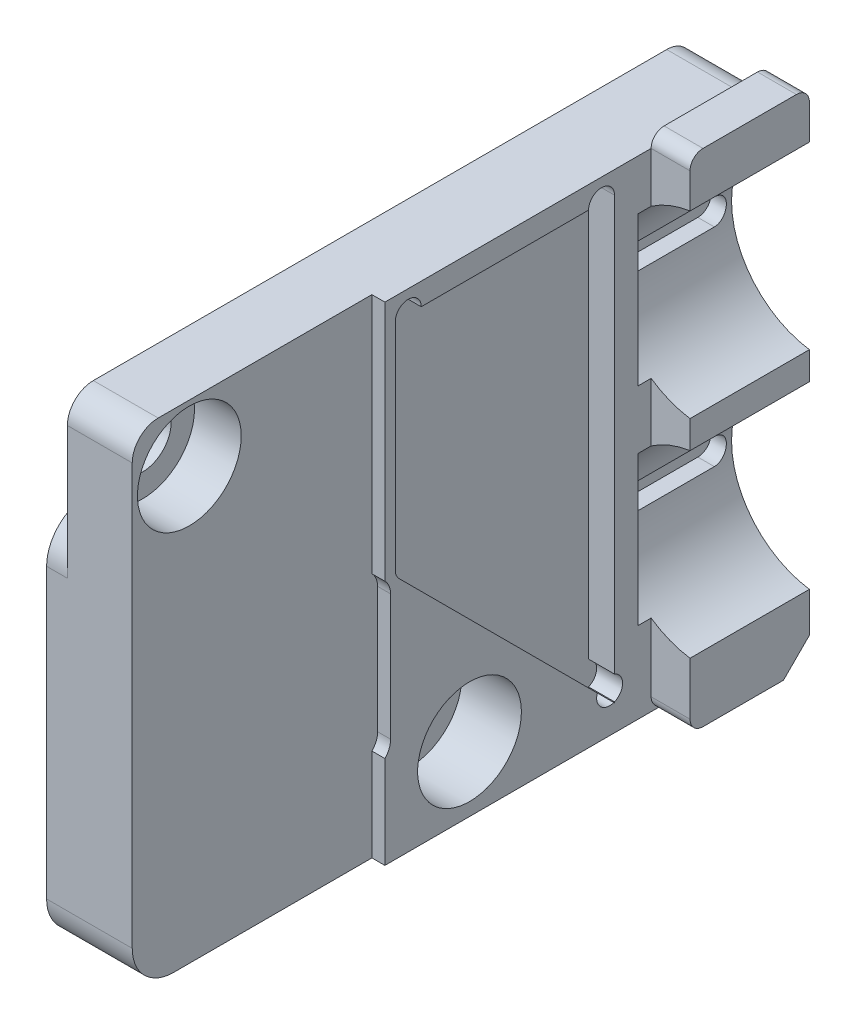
ISO-10303-21;
HEADER;
FILE_DESCRIPTION(('STEP AP214'),'2;1');
FILE_NAME('part.step','',(''),(''),'','','');
FILE_SCHEMA(('AUTOMOTIVE_DESIGN { 1 0 10303 214 1 1 1 1 }'));
ENDSEC;
DATA;
#1=APPLICATION_CONTEXT('core data for automotive mechanical design processes');
#2=APPLICATION_PROTOCOL_DEFINITION('international standard','automotive_design',2000,#1);
#3=PRODUCT_CONTEXT('',#1,'mechanical');
#4=PRODUCT('Part','Part','',(#3));
#5=PRODUCT_RELATED_PRODUCT_CATEGORY('part','',(#4));
#6=PRODUCT_DEFINITION_FORMATION('','',#4);
#7=PRODUCT_DEFINITION_CONTEXT('part definition',#1,'design');
#8=PRODUCT_DEFINITION('design','',#6,#7);
#9=PRODUCT_DEFINITION_SHAPE('','',#8);
#10=(LENGTH_UNIT() NAMED_UNIT(*) SI_UNIT(.MILLI.,.METRE.));
#11=(NAMED_UNIT(*) PLANE_ANGLE_UNIT() SI_UNIT($,.RADIAN.));
#12=(NAMED_UNIT(*) SI_UNIT($,.STERADIAN.) SOLID_ANGLE_UNIT());
#13=UNCERTAINTY_MEASURE_WITH_UNIT(LENGTH_MEASURE(1.E-05),#10,'distance_accuracy_value','');
#14=(GEOMETRIC_REPRESENTATION_CONTEXT(3) GLOBAL_UNCERTAINTY_ASSIGNED_CONTEXT((#13)) GLOBAL_UNIT_ASSIGNED_CONTEXT((#10,
#11,#12)) REPRESENTATION_CONTEXT('',''));
#15=CARTESIAN_POINT('',(0.,0.,0.));
#16=DIRECTION('',(0.,0.,1.));
#17=DIRECTION('',(1.,0.,0.));
#18=AXIS2_PLACEMENT_3D('',#15,#16,#17);
#19=CARTESIAN_POINT('',(-3.,11.9489929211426,3.96200000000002));
#20=DIRECTION('',(0.,0.,-1.));
#21=DIRECTION('',(0.,1.,0.));
#22=AXIS2_PLACEMENT_3D('',#19,#20,#21);
#23=PLANE('',#22);
#24=DIRECTION('',(0.,1.,0.));
#25=VECTOR('',#24,1.);
#26=CARTESIAN_POINT('',(-3.,11.9489929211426,3.96200000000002));
#27=LINE('',#26,#25);
#28=CARTESIAN_POINT('',(-3.,-4.03669016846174,3.96200000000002));
#29=VERTEX_POINT('',#28);
#30=CARTESIAN_POINT('',(-3.,11.9489929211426,3.96200000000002));
#31=VERTEX_POINT('',#30);
#32=EDGE_CURVE('E509',#29,#31,#27,.T.);
#33=ORIENTED_EDGE('',*,*,#32,.F.);
#34=DIRECTION('',(1.,0.,0.));
#35=VECTOR('',#34,1.);
#36=CARTESIAN_POINT('',(-4.41421356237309,-4.03669016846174,3.96200000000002));
#37=LINE('',#36,#35);
#38=CARTESIAN_POINT('',(-2.,-4.03669016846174,3.96200000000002));
#39=VERTEX_POINT('',#38);
#40=EDGE_CURVE('E909',#29,#39,#37,.T.);
#41=ORIENTED_EDGE('',*,*,#40,.T.);
#42=DIRECTION('',(0.,1.,0.));
#43=VECTOR('',#42,1.);
#44=CARTESIAN_POINT('',(-2.,11.9489929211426,3.96200000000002));
#45=LINE('',#44,#43);
#46=CARTESIAN_POINT('',(-2.,11.9489929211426,3.96200000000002));
#47=VERTEX_POINT('',#46);
#48=EDGE_CURVE('E522',#39,#47,#45,.T.);
#49=ORIENTED_EDGE('',*,*,#48,.T.);
#50=DIRECTION('',(1.,0.,0.));
#51=VECTOR('',#50,1.);
#52=CARTESIAN_POINT('',(-3.,11.9489929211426,3.96200000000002));
#53=LINE('',#52,#51);
#54=EDGE_CURVE('E531',#31,#47,#53,.T.);
#55=ORIENTED_EDGE('',*,*,#54,.F.);
#56=EDGE_LOOP('',(#33,#41,#49,#55));
#57=FACE_BOUND('',#56,.T.);
#58=ADVANCED_FACE('F35',(#57),#23,.F.);
#59=CARTESIAN_POINT('',(-3.,-5.00100707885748,3.96200000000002));
#60=DIRECTION('',(0.,-0.707106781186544,0.707106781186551));
#61=DIRECTION('',(0.,-0.707106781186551,-0.707106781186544));
#62=AXIS2_PLACEMENT_3D('',#59,#60,#61);
#63=PLANE('',#62);
#64=DIRECTION('',(0.,-0.707106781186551,-0.707106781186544));
#65=VECTOR('',#64,1.);
#66=CARTESIAN_POINT('',(-3.,-5.00100707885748,3.96200000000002));
#67=LINE('',#66,#65);
#68=CARTESIAN_POINT('',(-3.,-4.97353136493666,3.98947571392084));
#69=VERTEX_POINT('',#68);
#70=CARTESIAN_POINT('',(-3.,-5.00100707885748,3.96200000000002));
#71=VERTEX_POINT('',#70);
#72=EDGE_CURVE('E504',#69,#71,#67,.T.);
#73=ORIENTED_EDGE('',*,*,#72,.F.);
#74=DIRECTION('',(1.,0.,0.));
#75=VECTOR('',#74,1.);
#76=CARTESIAN_POINT('',(-4.41421356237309,-4.97353136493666,3.98947571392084));
#77=LINE('',#76,#75);
#78=CARTESIAN_POINT('',(-2.,-4.97353136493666,3.98947571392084));
#79=VERTEX_POINT('',#78);
#80=EDGE_CURVE('E903',#69,#79,#77,.T.);
#81=ORIENTED_EDGE('',*,*,#80,.T.);
#82=DIRECTION('',(0.,-0.707106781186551,-0.707106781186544));
#83=VECTOR('',#82,1.);
#84=CARTESIAN_POINT('',(-2.,-5.00100707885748,3.96200000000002));
#85=LINE('',#84,#83);
#86=CARTESIAN_POINT('',(-2.,-5.00100707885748,3.96200000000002));
#87=VERTEX_POINT('',#86);
#88=EDGE_CURVE('E518',#79,#87,#85,.T.);
#89=ORIENTED_EDGE('',*,*,#88,.T.);
#90=DIRECTION('',(1.,0.,0.));
#91=VECTOR('',#90,1.);
#92=CARTESIAN_POINT('',(-3.,-5.00100707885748,3.96200000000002));
#93=LINE('',#92,#91);
#94=EDGE_CURVE('E515',#71,#87,#93,.T.);
#95=ORIENTED_EDGE('',*,*,#94,.F.);
#96=EDGE_LOOP('',(#73,#81,#89,#95));
#97=FACE_BOUND('',#96,.T.);
#98=ADVANCED_FACE('F1101',(#97),#63,.F.);
#99=CARTESIAN_POINT('',(0.,12.8041016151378,0.));
#100=DIRECTION('',(0.,1.,0.));
#101=DIRECTION('',(0.,0.,1.));
#102=AXIS2_PLACEMENT_3D('',#99,#100,#101);
#103=PLANE('',#102);
#104=DIRECTION('',(0.,0.,1.));
#105=VECTOR('',#104,1.);
#106=CARTESIAN_POINT('',(-2.,12.8041016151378,-2.05));
#107=LINE('',#106,#105);
#108=CARTESIAN_POINT('',(-2.,12.8041016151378,-1.05));
#109=VERTEX_POINT('',#108);
#110=CARTESIAN_POINT('',(-2.,12.8041016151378,2.55));
#111=VERTEX_POINT('',#110);
#112=EDGE_CURVE('E919',#109,#111,#107,.T.);
#113=ORIENTED_EDGE('',*,*,#112,.F.);
#114=DIRECTION('',(1.,0.,0.));
#115=VECTOR('',#114,1.);
#116=CARTESIAN_POINT('',(0.,12.8041016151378,-1.05));
#117=LINE('',#116,#115);
#118=CARTESIAN_POINT('',(-5.,12.8041016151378,-1.04999999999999));
#119=VERTEX_POINT('',#118);
#120=EDGE_CURVE('E749',#109,#119,#117,.F.);
#121=ORIENTED_EDGE('',*,*,#120,.T.);
#122=DIRECTION('',(0.,0.,-1.));
#123=VECTOR('',#122,1.);
#124=CARTESIAN_POINT('',(-5.,12.8041016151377,21.05));
#125=LINE('',#124,#123);
#126=CARTESIAN_POINT('',(-5.,12.8041016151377,21.05));
#127=VERTEX_POINT('',#126);
#128=EDGE_CURVE('E452',#127,#119,#125,.T.);
#129=ORIENTED_EDGE('',*,*,#128,.F.);
#130=DIRECTION('',(1.,0.,0.));
#131=VECTOR('',#130,1.);
#132=CARTESIAN_POINT('',(-2.,12.8041016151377,21.05));
#133=LINE('',#132,#131);
#134=CARTESIAN_POINT('',(-2.5,12.8041016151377,21.05));
#135=VERTEX_POINT('',#134);
#136=EDGE_CURVE('E576',#127,#135,#133,.T.);
#137=ORIENTED_EDGE('',*,*,#136,.T.);
#138=DIRECTION('',(0.,0.,1.));
#139=VECTOR('',#138,1.);
#140=CARTESIAN_POINT('',(-2.5,12.8041016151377,12.812));
#141=LINE('',#140,#139);
#142=CARTESIAN_POINT('',(-2.5,12.8041016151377,12.812));
#143=VERTEX_POINT('',#142);
#144=EDGE_CURVE('E864',#143,#135,#141,.T.);
#145=ORIENTED_EDGE('',*,*,#144,.F.);
#146=DIRECTION('',(1.,0.,0.));
#147=VECTOR('',#146,1.);
#148=CARTESIAN_POINT('',(-3.,12.8041016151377,12.812));
#149=LINE('',#148,#147);
#150=CARTESIAN_POINT('',(-2.,12.8041016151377,12.812));
#151=VERTEX_POINT('',#150);
#152=EDGE_CURVE('E888',#143,#151,#149,.T.);
#153=ORIENTED_EDGE('',*,*,#152,.T.);
#154=DIRECTION('',(0.,0.,-1.));
#155=VECTOR('',#154,1.);
#156=CARTESIAN_POINT('',(-2.,12.8041016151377,22.05));
#157=LINE('',#156,#155);
#158=EDGE_CURVE('E497',#151,#111,#157,.T.);
#159=ORIENTED_EDGE('',*,*,#158,.T.);
#160=EDGE_LOOP('',(#113,#121,#129,#137,#145,#153,#159));
#161=FACE_BOUND('',#160,.T.);
#162=ADVANCED_FACE('F1046',(#161),#103,.T.);
#163=CARTESIAN_POINT('',(0.,-6.,0.));
#164=DIRECTION('',(0.,-1.,0.));
#165=DIRECTION('',(1.,0.,0.));
#166=AXIS2_PLACEMENT_3D('',#163,#164,#165);
#167=PLANE('',#166);
#168=DIRECTION('',(0.,0.,1.));
#169=VECTOR('',#168,1.);
#170=CARTESIAN_POINT('',(-5.8,-6.,-2.55));
#171=LINE('',#170,#169);
#172=CARTESIAN_POINT('',(-5.8,-6.,-1.05000000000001));
#173=VERTEX_POINT('',#172);
#174=CARTESIAN_POINT('',(-5.8,-6.,6.2));
#175=VERTEX_POINT('',#174);
#176=EDGE_CURVE('E442',#173,#175,#171,.T.);
#177=ORIENTED_EDGE('',*,*,#176,.F.);
#178=DIRECTION('',(1.,0.,0.));
#179=VECTOR('',#178,1.);
#180=CARTESIAN_POINT('',(0.,-6.,-1.05000000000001));
#181=LINE('',#180,#179);
#182=CARTESIAN_POINT('',(-0.499999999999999,-6.,-1.05000000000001));
#183=VERTEX_POINT('',#182);
#184=EDGE_CURVE('E43',#173,#183,#181,.T.);
#185=ORIENTED_EDGE('',*,*,#184,.T.);
#186=DIRECTION('',(0.,0.,1.));
#187=VECTOR('',#186,1.);
#188=CARTESIAN_POINT('',(-0.499999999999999,-6.,-2.55));
#189=LINE('',#188,#187);
#190=CARTESIAN_POINT('',(-0.499999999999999,-6.,2.05));
#191=VERTEX_POINT('',#190);
#192=EDGE_CURVE('E540',#183,#191,#189,.T.);
#193=ORIENTED_EDGE('',*,*,#192,.T.);
#194=DIRECTION('',(-1.,0.,0.));
#195=VECTOR('',#194,1.);
#196=CARTESIAN_POINT('',(-2.,-6.,2.05));
#197=LINE('',#196,#195);
#198=CARTESIAN_POINT('',(-2.,-6.,2.05));
#199=VERTEX_POINT('',#198);
#200=EDGE_CURVE('E731',#191,#199,#197,.T.);
#201=ORIENTED_EDGE('',*,*,#200,.T.);
#202=DIRECTION('',(0.,0.,-1.));
#203=VECTOR('',#202,1.);
#204=CARTESIAN_POINT('',(-2.,-6.,22.05));
#205=LINE('',#204,#203);
#206=CARTESIAN_POINT('',(-2.,-6.,12.812));
#207=VERTEX_POINT('',#206);
#208=EDGE_CURVE('E530',#207,#199,#205,.T.);
#209=ORIENTED_EDGE('',*,*,#208,.F.);
#210=DIRECTION('',(1.,0.,0.));
#211=VECTOR('',#210,1.);
#212=CARTESIAN_POINT('',(0.,-6.,12.812));
#213=LINE('',#212,#211);
#214=CARTESIAN_POINT('',(-2.5,-6.,12.812));
#215=VERTEX_POINT('',#214);
#216=EDGE_CURVE('E892',#215,#207,#213,.T.);
#217=ORIENTED_EDGE('',*,*,#216,.F.);
#218=DIRECTION('',(0.,0.,-1.));
#219=VECTOR('',#218,1.);
#220=CARTESIAN_POINT('',(-2.5,-6.,22.05));
#221=LINE('',#220,#219);
#222=CARTESIAN_POINT('',(-2.5,-6.,20.45));
#223=VERTEX_POINT('',#222);
#224=EDGE_CURVE('E873',#223,#215,#221,.T.);
#225=ORIENTED_EDGE('',*,*,#224,.F.);
#226=DIRECTION('',(-1.,0.,0.));
#227=VECTOR('',#226,1.);
#228=CARTESIAN_POINT('',(-5.8,-6.,20.45));
#229=LINE('',#228,#227);
#230=CARTESIAN_POINT('',(-5.8,-6.,20.45));
#231=VERTEX_POINT('',#230);
#232=EDGE_CURVE('E761',#223,#231,#229,.T.);
#233=ORIENTED_EDGE('',*,*,#232,.T.);
#234=CARTESIAN_POINT('',(-5.8,-6.,12.9));
#235=VERTEX_POINT('',#234);
#236=EDGE_CURVE('E447',#235,#231,#171,.T.);
#237=ORIENTED_EDGE('',*,*,#236,.F.);
#238=DIRECTION('',(-1.,0.,0.));
#239=VECTOR('',#238,1.);
#240=CARTESIAN_POINT('',(-5.,-6.,12.9));
#241=LINE('',#240,#239);
#242=CARTESIAN_POINT('',(-5.,-6.,12.9));
#243=VERTEX_POINT('',#242);
#244=EDGE_CURVE('E758',#235,#243,#241,.F.);
#245=ORIENTED_EDGE('',*,*,#244,.T.);
#246=DIRECTION('',(0.,0.,-1.));
#247=VECTOR('',#246,1.);
#248=CARTESIAN_POINT('',(-5.,-6.,7.8));
#249=LINE('',#248,#247);
#250=CARTESIAN_POINT('',(-5.,-6.,6.2));
#251=VERTEX_POINT('',#250);
#252=EDGE_CURVE('E847',#243,#251,#249,.T.);
#253=ORIENTED_EDGE('',*,*,#252,.T.);
#254=DIRECTION('',(-1.,0.,0.));
#255=VECTOR('',#254,1.);
#256=CARTESIAN_POINT('',(-5.8,-6.,6.2));
#257=LINE('',#256,#255);
#258=EDGE_CURVE('E755',#251,#175,#257,.T.);
#259=ORIENTED_EDGE('',*,*,#258,.T.);
#260=EDGE_LOOP('',(#177,#185,#193,#201,#209,#217,#225,#233,#237,#245,#253,#259));
#261=FACE_BOUND('',#260,.T.);
#262=ADVANCED_FACE('F838',(#261),#167,.T.);
#263=CARTESIAN_POINT('',(-0.5,11.4641016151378,-2.75));
#264=DIRECTION('',(1.,0.,0.));
#265=DIRECTION('',(0.,0.,-1.));
#266=AXIS2_PLACEMENT_3D('',#263,#264,#265);
#267=PLANE('',#266);
#268=DIRECTION('',(0.,-1.,0.));
#269=VECTOR('',#268,1.);
#270=CARTESIAN_POINT('',(-0.5,13.3041016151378,-2.05));
#271=LINE('',#270,#269);
#272=CARTESIAN_POINT('',(-0.5,12.8041016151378,-2.05));
#273=VERTEX_POINT('',#272);
#274=CARTESIAN_POINT('',(-0.5,11.4641016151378,-2.05));
#275=VERTEX_POINT('',#274);
#276=EDGE_CURVE('E805',#273,#275,#271,.T.);
#277=ORIENTED_EDGE('',*,*,#276,.F.);
#278=CARTESIAN_POINT('',(-0.5,12.8041016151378,-1.55));
#279=DIRECTION('',(1.,0.,0.));
#280=DIRECTION('',(0.,0.,-1.));
#281=AXIS2_PLACEMENT_3D('',#278,#279,#280);
#282=CIRCLE('',#281,0.5);
#283=CARTESIAN_POINT('',(-0.5,13.3041016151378,-1.55));
#284=VERTEX_POINT('',#283);
#285=EDGE_CURVE('E716',#273,#284,#282,.T.);
#286=ORIENTED_EDGE('',*,*,#285,.T.);
#287=DIRECTION('',(0.,0.,1.));
#288=VECTOR('',#287,1.);
#289=CARTESIAN_POINT('',(-0.5,13.3041016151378,2.55));
#290=LINE('',#289,#288);
#291=CARTESIAN_POINT('',(-0.5,13.3041016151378,2.05));
#292=VERTEX_POINT('',#291);
#293=EDGE_CURVE('E543',#284,#292,#290,.T.);
#294=ORIENTED_EDGE('',*,*,#293,.T.);
#295=CARTESIAN_POINT('',(-0.5,12.8041016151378,2.05));
#296=DIRECTION('',(1.,0.,0.));
#297=DIRECTION('',(0.,0.,-1.));
#298=AXIS2_PLACEMENT_3D('',#295,#296,#297);
#299=CIRCLE('',#298,0.5);
#300=CARTESIAN_POINT('',(-0.5,12.8041016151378,2.55));
#301=VERTEX_POINT('',#300);
#302=EDGE_CURVE('E714',#292,#301,#299,.T.);
#303=ORIENTED_EDGE('',*,*,#302,.T.);
#304=DIRECTION('',(0.,1.,0.));
#305=VECTOR('',#304,1.);
#306=CARTESIAN_POINT('',(-0.5,12.5041016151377,2.55));
#307=LINE('',#306,#305);
#308=CARTESIAN_POINT('',(-0.5,11.4641016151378,2.55));
#309=VERTEX_POINT('',#308);
#310=EDGE_CURVE('E546',#309,#301,#307,.T.);
#311=ORIENTED_EDGE('',*,*,#310,.F.);
#312=DIRECTION('',(0.,0.,1.));
#313=VECTOR('',#312,1.);
#314=CARTESIAN_POINT('',(-0.5,11.4641016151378,-2.75));
#315=LINE('',#314,#313);
#316=EDGE_CURVE('E559',#275,#309,#315,.T.);
#317=ORIENTED_EDGE('',*,*,#316,.F.);
#318=EDGE_LOOP('',(#277,#286,#294,#303,#311,#317));
#319=FACE_BOUND('',#318,.T.);
#320=ADVANCED_FACE('F1195',(#319),#267,.T.);
#321=CARTESIAN_POINT('',(0.,8.,-2.75));
#322=DIRECTION('',(0.,0.,1.));
#323=DIRECTION('',(1.,0.,0.));
#324=AXIS2_PLACEMENT_3D('',#321,#322,#323);
#325=CYLINDRICAL_SURFACE('',#324,3.5);
#326=CARTESIAN_POINT('',(-3.46410161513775,8.5,2.25));
#327=CARTESIAN_POINT('',(-3.4641020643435,8.49999883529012,2.27793104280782));
#328=CARTESIAN_POINT('',(-3.46444308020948,8.49765166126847,2.30587867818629));
#329=CARTESIAN_POINT('',(-3.46576949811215,8.48832685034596,2.3609936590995));
#330=CARTESIAN_POINT('',(-3.46675554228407,8.4813445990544,2.38816019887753));
#331=CARTESIAN_POINT('',(-3.46925810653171,8.4629618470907,2.44090717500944));
#332=CARTESIAN_POINT('',(-3.4707742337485,8.45156461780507,2.46648876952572));
#333=CARTESIAN_POINT('',(-3.47416566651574,8.42468293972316,2.51537243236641));
#334=CARTESIAN_POINT('',(-3.47604091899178,8.40919909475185,2.53867483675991));
#335=CARTESIAN_POINT('',(-3.47995456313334,8.37446336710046,2.58251207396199));
#336=CARTESIAN_POINT('',(-3.48199393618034,8.35518764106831,2.60302792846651));
#337=CARTESIAN_POINT('',(-3.48599725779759,8.3134667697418,2.6405453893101));
#338=CARTESIAN_POINT('',(-3.48796120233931,8.29102145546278,2.65754680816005));
#339=CARTESIAN_POINT('',(-3.49160259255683,8.24347759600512,2.68762227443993));
#340=CARTESIAN_POINT('',(-3.49327875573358,8.21836794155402,2.70067892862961));
#341=CARTESIAN_POINT('',(-3.49614487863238,8.16628418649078,2.72238268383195));
#342=CARTESIAN_POINT('',(-3.49733486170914,8.13931017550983,2.73102999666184));
#343=CARTESIAN_POINT('',(-3.49908762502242,8.08445851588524,2.74361230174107));
#344=CARTESIAN_POINT('',(-3.49965462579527,8.05658828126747,2.74757901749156));
#345=CARTESIAN_POINT('',(-3.50011198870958,8.0005723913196,2.75078597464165));
#346=CARTESIAN_POINT('',(-3.50000238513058,7.97242675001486,2.75002645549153));
#347=CARTESIAN_POINT('',(-3.49912227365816,7.91687525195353,2.74382765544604));
#348=CARTESIAN_POINT('',(-3.49835658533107,7.88946550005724,2.73842250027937));
#349=CARTESIAN_POINT('',(-3.49625571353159,7.83594610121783,2.7231393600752));
#350=CARTESIAN_POINT('',(-3.49492051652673,7.80983648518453,2.71326126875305));
#351=CARTESIAN_POINT('',(-3.49182235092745,7.75955450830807,2.68927731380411));
#352=CARTESIAN_POINT('',(-3.49005792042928,7.73538915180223,2.67515696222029));
#353=CARTESIAN_POINT('',(-3.48629816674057,7.68975804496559,2.64309987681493));
#354=CARTESIAN_POINT('',(-3.48430282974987,7.66829245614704,2.62516291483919));
#355=CARTESIAN_POINT('',(-3.48028301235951,7.62846925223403,2.585791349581));
#356=CARTESIAN_POINT('',(-3.47825843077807,7.61014107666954,2.5643269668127));
#357=CARTESIAN_POINT('',(-3.47442573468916,7.57734252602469,2.51861136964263));
#358=CARTESIAN_POINT('',(-3.47261762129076,7.56287217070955,2.49436014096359));
#359=CARTESIAN_POINT('',(-3.46942263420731,7.53819674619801,2.44372992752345));
#360=CARTESIAN_POINT('',(-3.46803603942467,7.52799449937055,2.41734954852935));
#361=CARTESIAN_POINT('',(-3.46584616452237,7.5121734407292,2.36322560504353));
#362=CARTESIAN_POINT('',(-3.46504284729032,7.50655433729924,2.33548212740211));
#363=CARTESIAN_POINT('',(-3.4641174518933,7.50009902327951,2.27968086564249));
#364=CARTESIAN_POINT('',(-3.46398944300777,7.49922117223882,2.2516279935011));
#365=CARTESIAN_POINT('',(-3.46441343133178,7.5021629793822,2.19577554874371));
#366=CARTESIAN_POINT('',(-3.46496540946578,7.50598250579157,2.16797596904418));
#367=CARTESIAN_POINT('',(-3.46668174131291,7.518175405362,2.11354695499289));
#368=CARTESIAN_POINT('',(-3.46784332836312,7.52652821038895,2.08691281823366));
#369=CARTESIAN_POINT('',(-3.47064572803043,7.54752923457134,2.03542280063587));
#370=CARTESIAN_POINT('',(-3.47228656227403,7.56017764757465,2.01056700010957));
#371=CARTESIAN_POINT('',(-3.47587662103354,7.58951159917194,1.96315203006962));
#372=CARTESIAN_POINT('',(-3.47782788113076,7.60622419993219,1.94060975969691));
#373=CARTESIAN_POINT('',(-3.48181272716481,7.64317430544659,1.89863506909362));
#374=CARTESIAN_POINT('',(-3.48384631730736,7.66341199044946,1.87920280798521));
#375=CARTESIAN_POINT('',(-3.48778513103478,7.70702072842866,1.84385119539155));
#376=CARTESIAN_POINT('',(-3.48968927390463,7.73041420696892,1.82795936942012));
#377=CARTESIAN_POINT('',(-3.49313805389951,7.7795628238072,1.80033110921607));
#378=CARTESIAN_POINT('',(-3.49468270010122,7.80531790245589,1.78859457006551));
#379=CARTESIAN_POINT('',(-3.4972336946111,7.85837101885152,1.76965447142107));
#380=CARTESIAN_POINT('',(-3.49824185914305,7.88566350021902,1.76243560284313));
#381=CARTESIAN_POINT('',(-3.49961389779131,7.94108868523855,1.75268613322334));
#382=CARTESIAN_POINT('',(-3.49997781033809,7.96922133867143,1.75015525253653));
#383=CARTESIAN_POINT('',(-3.50002001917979,8.02526078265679,1.74985994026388));
#384=CARTESIAN_POINT('',(-3.49970438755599,8.05316735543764,1.75205329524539));
#385=CARTESIAN_POINT('',(-3.49843516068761,8.10821065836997,1.76105403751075));
#386=CARTESIAN_POINT('',(-3.49748156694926,8.13534739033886,1.76786141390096));
#387=CARTESIAN_POINT('',(-3.49504305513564,8.18807092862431,1.78588249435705));
#388=CARTESIAN_POINT('',(-3.49355845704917,8.21365865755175,1.79709354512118));
#389=CARTESIAN_POINT('',(-3.49022140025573,8.26259642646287,1.8235992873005));
#390=CARTESIAN_POINT('',(-3.48836893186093,8.28594640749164,1.83889408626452));
#391=CARTESIAN_POINT('',(-3.48448261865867,8.32996048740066,1.87328692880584));
#392=CARTESIAN_POINT('',(-3.48244736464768,8.35060004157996,1.89241622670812));
#393=CARTESIAN_POINT('',(-3.47843555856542,8.38839179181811,1.93386939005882));
#394=CARTESIAN_POINT('',(-3.47645902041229,8.40554316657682,1.95619400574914));
#395=CARTESIAN_POINT('',(-3.47277771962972,8.43594880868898,2.0035363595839));
#396=CARTESIAN_POINT('',(-3.47107438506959,8.44918288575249,2.02856717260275));
#397=CARTESIAN_POINT('',(-3.46814907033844,8.47123975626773,2.08050807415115));
#398=CARTESIAN_POINT('',(-3.46692658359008,8.48006719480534,2.10741614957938));
#399=CARTESIAN_POINT('',(-3.46538823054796,8.49102313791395,2.15370910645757));
#400=CARTESIAN_POINT('',(-3.46490825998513,8.49438440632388,2.17280608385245));
#401=CARTESIAN_POINT('',(-3.46426479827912,8.49887322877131,2.21126604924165));
#402=CARTESIAN_POINT('',(-3.4641013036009,8.50000080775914,2.23062903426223));
#403=CARTESIAN_POINT('',(-3.46410161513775,8.5,2.25));
#404=B_SPLINE_CURVE_WITH_KNOTS('',3,(#326,#327,#328,#329,#330,#331,#332,#333,#334,#335,#336,
#337,#338,#339,#340,#341,#342,#343,#344,#345,#346,#347,#348,#349,#350,#351,#352,#353,#354,#355,
#356,#357,#358,#359,#360,#361,#362,#363,#364,#365,#366,#367,#368,#369,#370,#371,#372,#373,#374,
#375,#376,#377,#378,#379,#380,#381,#382,#383,#384,#385,#386,#387,#388,#389,#390,#391,#392,#393,
#394,#395,#396,#397,#398,#399,#400,#401,#402,#403),.UNSPECIFIED.,.T.,.F.,(4,2,2,2,2,2,2,2,2,2,2,
2,2,2,2,2,2,2,2,2,2,2,2,2,2,2,2,2,2,2,2,2,2,2,2,2,2,2,4),(0.,0.0837223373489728,
0.16752814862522,0.251271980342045,0.335003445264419,0.419279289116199,0.503559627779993,
0.588206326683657,0.672848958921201,0.756914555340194,0.840975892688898,0.924424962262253,
1.00787601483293,1.09161536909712,1.17535973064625,1.25985129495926,1.34434329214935,
1.42889107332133,1.51343347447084,1.59723215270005,1.68102848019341,1.7644477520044,
1.84787078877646,1.93186530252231,2.01586411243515,2.10049480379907,2.1851233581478,
2.26946355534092,2.35379872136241,2.43738343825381,2.5209679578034,2.60450219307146,
2.68803862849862,2.77228587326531,2.85655293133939,2.94124703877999,3.0258516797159,
3.0839161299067,3.14197993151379),.UNSPECIFIED.);
#405=CARTESIAN_POINT('',(-3.46410161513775,8.5,2.25));
#406=VERTEX_POINT('',#405);
#407=CARTESIAN_POINT('',(-3.46410161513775,7.5,2.25));
#408=VERTEX_POINT('',#407);
#409=EDGE_CURVE('E675',#406,#408,#404,.T.);
#410=ORIENTED_EDGE('',*,*,#409,.F.);
#411=DIRECTION('',(0.,0.,1.));
#412=VECTOR('',#411,1.);
#413=CARTESIAN_POINT('',(-3.46410161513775,8.5,-2.75));
#414=LINE('',#413,#412);
#415=CARTESIAN_POINT('',(-3.46410161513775,8.5,-1.35));
#416=VERTEX_POINT('',#415);
#417=EDGE_CURVE('E653',#416,#406,#414,.T.);
#418=ORIENTED_EDGE('',*,*,#417,.F.);
#419=CARTESIAN_POINT('',(-3.46410161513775,8.5,-1.35));
#420=CARTESIAN_POINT('',(-3.4641020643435,8.49999883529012,-1.32206895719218));
#421=CARTESIAN_POINT('',(-3.46444308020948,8.49765166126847,-1.29412132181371));
#422=CARTESIAN_POINT('',(-3.46576949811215,8.48832685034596,-1.2390063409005));
#423=CARTESIAN_POINT('',(-3.46675554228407,8.4813445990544,-1.21183980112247));
#424=CARTESIAN_POINT('',(-3.46925810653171,8.4629618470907,-1.15909282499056));
#425=CARTESIAN_POINT('',(-3.4707742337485,8.45156461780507,-1.13351123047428));
#426=CARTESIAN_POINT('',(-3.47416566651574,8.42468293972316,-1.08462756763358));
#427=CARTESIAN_POINT('',(-3.47604091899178,8.40919909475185,-1.06132516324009));
#428=CARTESIAN_POINT('',(-3.47995456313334,8.37446336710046,-1.01748792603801));
#429=CARTESIAN_POINT('',(-3.48199393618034,8.35518764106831,-0.996972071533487));
#430=CARTESIAN_POINT('',(-3.48599725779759,8.3134667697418,-0.959454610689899));
#431=CARTESIAN_POINT('',(-3.48796120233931,8.29102145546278,-0.942453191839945));
#432=CARTESIAN_POINT('',(-3.49160259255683,8.24347759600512,-0.912377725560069));
#433=CARTESIAN_POINT('',(-3.49327875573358,8.21836794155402,-0.899321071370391));
#434=CARTESIAN_POINT('',(-3.49614487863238,8.16628418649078,-0.87761731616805));
#435=CARTESIAN_POINT('',(-3.49733486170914,8.13931017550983,-0.868970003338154));
#436=CARTESIAN_POINT('',(-3.49908762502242,8.08445851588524,-0.856387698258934));
#437=CARTESIAN_POINT('',(-3.49965462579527,8.05658828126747,-0.852420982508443));
#438=CARTESIAN_POINT('',(-3.50011198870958,8.0005723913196,-0.849214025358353));
#439=CARTESIAN_POINT('',(-3.50000238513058,7.97242675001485,-0.849973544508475));
#440=CARTESIAN_POINT('',(-3.49912227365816,7.91687525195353,-0.856172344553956));
#441=CARTESIAN_POINT('',(-3.49835658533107,7.88946550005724,-0.86157749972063));
#442=CARTESIAN_POINT('',(-3.49625571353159,7.83594610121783,-0.876860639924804));
#443=CARTESIAN_POINT('',(-3.49492051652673,7.80983648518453,-0.886738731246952));
#444=CARTESIAN_POINT('',(-3.49182235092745,7.75955450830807,-0.910722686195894));
#445=CARTESIAN_POINT('',(-3.49005792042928,7.73538915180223,-0.924843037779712));
#446=CARTESIAN_POINT('',(-3.48629816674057,7.68975804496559,-0.956900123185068));
#447=CARTESIAN_POINT('',(-3.48430282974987,7.66829245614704,-0.974837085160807));
#448=CARTESIAN_POINT('',(-3.48028301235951,7.62846925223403,-1.014208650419));
#449=CARTESIAN_POINT('',(-3.47825843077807,7.61014107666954,-1.0356730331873));
#450=CARTESIAN_POINT('',(-3.47442573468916,7.57734252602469,-1.08138863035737));
#451=CARTESIAN_POINT('',(-3.47261762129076,7.56287217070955,-1.10563985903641));
#452=CARTESIAN_POINT('',(-3.46942263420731,7.53819674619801,-1.15627007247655));
#453=CARTESIAN_POINT('',(-3.46803603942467,7.52799449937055,-1.18265045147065));
#454=CARTESIAN_POINT('',(-3.46584616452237,7.5121734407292,-1.23677439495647));
#455=CARTESIAN_POINT('',(-3.46504284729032,7.50655433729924,-1.26451787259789));
#456=CARTESIAN_POINT('',(-3.4641174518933,7.50009902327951,-1.32031913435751));
#457=CARTESIAN_POINT('',(-3.46398944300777,7.49922117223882,-1.3483720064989));
#458=CARTESIAN_POINT('',(-3.46441343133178,7.5021629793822,-1.40422445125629));
#459=CARTESIAN_POINT('',(-3.46496540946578,7.50598250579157,-1.43202403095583));
#460=CARTESIAN_POINT('',(-3.46668174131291,7.518175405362,-1.48645304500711));
#461=CARTESIAN_POINT('',(-3.46784332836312,7.52652821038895,-1.51308718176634));
#462=CARTESIAN_POINT('',(-3.47064572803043,7.54752923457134,-1.56457719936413));
#463=CARTESIAN_POINT('',(-3.47228656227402,7.56017764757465,-1.58943299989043));
#464=CARTESIAN_POINT('',(-3.47587662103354,7.58951159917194,-1.63684796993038));
#465=CARTESIAN_POINT('',(-3.47782788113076,7.60622419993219,-1.65939024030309));
#466=CARTESIAN_POINT('',(-3.48181272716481,7.64317430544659,-1.70136493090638));
#467=CARTESIAN_POINT('',(-3.48384631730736,7.66341199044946,-1.72079719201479));
#468=CARTESIAN_POINT('',(-3.48778513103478,7.70702072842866,-1.75614880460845));
#469=CARTESIAN_POINT('',(-3.48968927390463,7.73041420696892,-1.77204063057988));
#470=CARTESIAN_POINT('',(-3.49313805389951,7.7795628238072,-1.79966889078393));
#471=CARTESIAN_POINT('',(-3.49468270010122,7.80531790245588,-1.81140542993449));
#472=CARTESIAN_POINT('',(-3.4972336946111,7.85837101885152,-1.83034552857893));
#473=CARTESIAN_POINT('',(-3.49824185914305,7.88566350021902,-1.83756439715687));
#474=CARTESIAN_POINT('',(-3.49961389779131,7.94108868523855,-1.84731386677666));
#475=CARTESIAN_POINT('',(-3.49997781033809,7.96922133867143,-1.84984474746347));
#476=CARTESIAN_POINT('',(-3.50002001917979,8.02526078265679,-1.85014005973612));
#477=CARTESIAN_POINT('',(-3.49970438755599,8.05316735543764,-1.84794670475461));
#478=CARTESIAN_POINT('',(-3.49843516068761,8.10821065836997,-1.83894596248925));
#479=CARTESIAN_POINT('',(-3.49748156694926,8.13534739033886,-1.83213858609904));
#480=CARTESIAN_POINT('',(-3.49504305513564,8.18807092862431,-1.81411750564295));
#481=CARTESIAN_POINT('',(-3.49355845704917,8.21365865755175,-1.80290645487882));
#482=CARTESIAN_POINT('',(-3.49022140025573,8.26259642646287,-1.7764007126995));
#483=CARTESIAN_POINT('',(-3.48836893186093,8.28594640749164,-1.76110591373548));
#484=CARTESIAN_POINT('',(-3.48448261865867,8.32996048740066,-1.72671307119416));
#485=CARTESIAN_POINT('',(-3.48244736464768,8.35060004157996,-1.70758377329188));
#486=CARTESIAN_POINT('',(-3.47843555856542,8.38839179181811,-1.66613060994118));
#487=CARTESIAN_POINT('',(-3.47645902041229,8.40554316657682,-1.64380599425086));
#488=CARTESIAN_POINT('',(-3.47277771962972,8.43594880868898,-1.5964636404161));
#489=CARTESIAN_POINT('',(-3.47107438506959,8.44918288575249,-1.57143282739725));
#490=CARTESIAN_POINT('',(-3.46814907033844,8.47123975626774,-1.51949192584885));
#491=CARTESIAN_POINT('',(-3.46692658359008,8.48006719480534,-1.49258385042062));
#492=CARTESIAN_POINT('',(-3.46538823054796,8.49102313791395,-1.44629089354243));
#493=CARTESIAN_POINT('',(-3.46490825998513,8.49438440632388,-1.42719391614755));
#494=CARTESIAN_POINT('',(-3.46426479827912,8.49887322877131,-1.38873395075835));
#495=CARTESIAN_POINT('',(-3.4641013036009,8.50000080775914,-1.36937096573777));
#496=CARTESIAN_POINT('',(-3.46410161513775,8.5,-1.35));
#497=B_SPLINE_CURVE_WITH_KNOTS('',3,(#419,#420,#421,#422,#423,#424,#425,#426,#427,#428,#429,
#430,#431,#432,#433,#434,#435,#436,#437,#438,#439,#440,#441,#442,#443,#444,#445,#446,#447,#448,
#449,#450,#451,#452,#453,#454,#455,#456,#457,#458,#459,#460,#461,#462,#463,#464,#465,#466,#467,
#468,#469,#470,#471,#472,#473,#474,#475,#476,#477,#478,#479,#480,#481,#482,#483,#484,#485,#486,
#487,#488,#489,#490,#491,#492,#493,#494,#495,#496),.UNSPECIFIED.,.T.,.F.,(4,2,2,2,2,2,2,2,2,2,2,
2,2,2,2,2,2,2,2,2,2,2,2,2,2,2,2,2,2,2,2,2,2,2,2,2,2,2,4),(0.,0.0837223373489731,
0.16752814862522,0.251271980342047,0.335003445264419,0.419279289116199,0.503559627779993,
0.588206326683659,0.672848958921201,0.756914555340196,0.8409758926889,0.924424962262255,
1.00787601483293,1.09161536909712,1.17535973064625,1.25985129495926,1.34434329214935,
1.42889107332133,1.51343347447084,1.59723215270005,1.68102848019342,1.7644477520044,
1.84787078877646,1.93186530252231,2.01586411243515,2.10049480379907,2.1851233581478,
2.26946355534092,2.35379872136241,2.43738343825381,2.5209679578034,2.60450219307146,
2.68803862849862,2.77228587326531,2.85655293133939,2.94124703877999,3.0258516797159,
3.0839161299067,3.14197993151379),.UNSPECIFIED.);
#498=CARTESIAN_POINT('',(-3.46410161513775,7.5,-1.35));
#499=VERTEX_POINT('',#498);
#500=EDGE_CURVE('E647',#499,#416,#497,.T.);
#501=ORIENTED_EDGE('',*,*,#500,.F.);
#502=DIRECTION('',(0.,0.,1.));
#503=VECTOR('',#502,1.);
#504=CARTESIAN_POINT('',(-3.46410161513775,7.5,-2.75));
#505=LINE('',#504,#503);
#506=EDGE_CURVE('E645',#408,#499,#505,.F.);
#507=ORIENTED_EDGE('',*,*,#506,.F.);
#508=EDGE_LOOP('',(#410,#418,#501,#507));
#509=FACE_BOUND('',#508,.T.);
#510=DIRECTION('',(0.,0.,1.));
#511=VECTOR('',#510,1.);
#512=CARTESIAN_POINT('',(-0.5,4.53589838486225,-2.75));
#513=LINE('',#512,#511);
#514=CARTESIAN_POINT('',(-0.499999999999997,4.53589838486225,-2.05));
#515=VERTEX_POINT('',#514);
#516=CARTESIAN_POINT('',(-0.5,4.53589838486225,2.55));
#517=VERTEX_POINT('',#516);
#518=EDGE_CURVE('E562',#515,#517,#513,.T.);
#519=ORIENTED_EDGE('',*,*,#518,.F.);
#520=CARTESIAN_POINT('',(0.,8.,-2.05));
#521=DIRECTION('',(0.,0.,1.));
#522=DIRECTION('',(0.,1.,0.));
#523=AXIS2_PLACEMENT_3D('',#520,#521,#522);
#524=CIRCLE('',#523,3.5);
#525=EDGE_CURVE('E808',#275,#515,#524,.T.);
#526=ORIENTED_EDGE('',*,*,#525,.F.);
#527=ORIENTED_EDGE('',*,*,#316,.T.);
#528=CARTESIAN_POINT('',(0.,8.,2.55));
#529=DIRECTION('',(0.,0.,-1.));
#530=DIRECTION('',(0.,1.,0.));
#531=AXIS2_PLACEMENT_3D('',#528,#529,#530);
#532=CIRCLE('',#531,3.5);
#533=CARTESIAN_POINT('',(-2.,10.872281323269,2.55));
#534=VERTEX_POINT('',#533);
#535=EDGE_CURVE('E554',#534,#309,#532,.T.);
#536=ORIENTED_EDGE('',*,*,#535,.F.);
#537=DIRECTION('',(0.,0.,-1.));
#538=VECTOR('',#537,1.);
#539=CARTESIAN_POINT('',(-2.,10.872281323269,3.05));
#540=LINE('',#539,#538);
#541=CARTESIAN_POINT('',(-2.,10.872281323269,3.05));
#542=VERTEX_POINT('',#541);
#543=EDGE_CURVE('E977',#542,#534,#540,.T.);
#544=ORIENTED_EDGE('',*,*,#543,.F.);
#545=CARTESIAN_POINT('',(0.,8.,3.05));
#546=DIRECTION('',(0.,0.,-1.));
#547=DIRECTION('',(0.,1.,0.));
#548=AXIS2_PLACEMENT_3D('',#545,#546,#547);
#549=CIRCLE('',#548,3.5);
#550=CARTESIAN_POINT('',(-2.,5.12771867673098,3.05));
#551=VERTEX_POINT('',#550);
#552=EDGE_CURVE('E965',#551,#542,#549,.T.);
#553=ORIENTED_EDGE('',*,*,#552,.F.);
#554=DIRECTION('',(0.,0.,-1.));
#555=VECTOR('',#554,1.);
#556=CARTESIAN_POINT('',(-2.,5.12771867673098,3.05));
#557=LINE('',#556,#555);
#558=CARTESIAN_POINT('',(-2.,5.12771867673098,2.55));
#559=VERTEX_POINT('',#558);
#560=EDGE_CURVE('E978',#551,#559,#557,.T.);
#561=ORIENTED_EDGE('',*,*,#560,.T.);
#562=EDGE_CURVE('E555',#517,#559,#532,.T.);
#563=ORIENTED_EDGE('',*,*,#562,.F.);
#564=EDGE_LOOP('',(#519,#526,#527,#536,#544,#553,#561,#563));
#565=FACE_BOUND('',#564,.T.);
#566=ADVANCED_FACE('F655',(#509,#565),#325,.F.);
#567=CARTESIAN_POINT('',(-0.5,3.46410161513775,-2.75));
#568=DIRECTION('',(1.,0.,0.));
#569=DIRECTION('',(0.,1.,0.));
#570=AXIS2_PLACEMENT_3D('',#567,#568,#569);
#571=PLANE('',#570);
#572=DIRECTION('',(0.,0.,1.));
#573=VECTOR('',#572,1.);
#574=CARTESIAN_POINT('',(-0.5,3.46410161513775,-2.75));
#575=LINE('',#574,#573);
#576=CARTESIAN_POINT('',(-0.5,3.46410161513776,-2.05));
#577=VERTEX_POINT('',#576);
#578=CARTESIAN_POINT('',(-0.5,3.46410161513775,2.55));
#579=VERTEX_POINT('',#578);
#580=EDGE_CURVE('E564',#577,#579,#575,.T.);
#581=ORIENTED_EDGE('',*,*,#580,.F.);
#582=DIRECTION('',(0.,-1.,0.));
#583=VECTOR('',#582,1.);
#584=CARTESIAN_POINT('',(-0.499999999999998,4.53589838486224,-2.05));
#585=LINE('',#584,#583);
#586=EDGE_CURVE('E816',#515,#577,#585,.T.);
#587=ORIENTED_EDGE('',*,*,#586,.F.);
#588=ORIENTED_EDGE('',*,*,#518,.T.);
#589=EDGE_CURVE('E550',#579,#517,#307,.T.);
#590=ORIENTED_EDGE('',*,*,#589,.F.);
#591=EDGE_LOOP('',(#581,#587,#588,#590));
#592=FACE_BOUND('',#591,.T.);
#593=ADVANCED_FACE('F1009',(#592),#571,.T.);
#594=CARTESIAN_POINT('',(0.,0.,-2.75));
#595=DIRECTION('',(0.,0.,1.));
#596=DIRECTION('',(1.,0.,0.));
#597=AXIS2_PLACEMENT_3D('',#594,#595,#596);
#598=CYLINDRICAL_SURFACE('',#597,3.5);
#599=CARTESIAN_POINT('',(-3.46410161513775,0.5,2.25));
#600=CARTESIAN_POINT('',(-3.4641020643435,0.49999883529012,2.27793104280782));
#601=CARTESIAN_POINT('',(-3.46444308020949,0.49765166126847,2.30587867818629));
#602=CARTESIAN_POINT('',(-3.46576949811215,0.488326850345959,2.3609936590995));
#603=CARTESIAN_POINT('',(-3.46675554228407,0.481344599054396,2.38816019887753));
#604=CARTESIAN_POINT('',(-3.46925810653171,0.462961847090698,2.44090717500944));
#605=CARTESIAN_POINT('',(-3.4707742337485,0.451564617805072,2.46648876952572));
#606=CARTESIAN_POINT('',(-3.47416566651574,0.424682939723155,2.51537243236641));
#607=CARTESIAN_POINT('',(-3.47604091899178,0.409199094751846,2.53867483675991));
#608=CARTESIAN_POINT('',(-3.47995456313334,0.374463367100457,2.58251207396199));
#609=CARTESIAN_POINT('',(-3.48199393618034,0.355187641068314,2.60302792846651));
#610=CARTESIAN_POINT('',(-3.48599725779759,0.313466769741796,2.6405453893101));
#611=CARTESIAN_POINT('',(-3.48796120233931,0.291021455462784,2.65754680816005));
#612=CARTESIAN_POINT('',(-3.49160259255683,0.243477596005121,2.68762227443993));
#613=CARTESIAN_POINT('',(-3.49327875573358,0.218367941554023,2.70067892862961));
#614=CARTESIAN_POINT('',(-3.49614487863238,0.166284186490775,2.72238268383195));
#615=CARTESIAN_POINT('',(-3.49733486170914,0.139310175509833,2.73102999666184));
#616=CARTESIAN_POINT('',(-3.49908762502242,0.0844585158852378,2.74361230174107));
#617=CARTESIAN_POINT('',(-3.49965462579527,0.0565882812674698,2.74757901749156));
#618=CARTESIAN_POINT('',(-3.50011198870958,0.000572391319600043,2.75078597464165));
#619=CARTESIAN_POINT('',(-3.50000238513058,-0.0275732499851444,2.75002645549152));
#620=CARTESIAN_POINT('',(-3.49912227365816,-0.0831247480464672,2.74382765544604));
#621=CARTESIAN_POINT('',(-3.49835658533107,-0.110534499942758,2.73842250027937));
#622=CARTESIAN_POINT('',(-3.49625571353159,-0.164053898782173,2.7231393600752));
#623=CARTESIAN_POINT('',(-3.49492051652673,-0.190163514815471,2.71326126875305));
#624=CARTESIAN_POINT('',(-3.49182235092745,-0.240445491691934,2.68927731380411));
#625=CARTESIAN_POINT('',(-3.49005792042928,-0.264610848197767,2.67515696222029));
#626=CARTESIAN_POINT('',(-3.48629816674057,-0.310241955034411,2.64309987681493));
#627=CARTESIAN_POINT('',(-3.48430282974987,-0.331707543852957,2.62516291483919));
#628=CARTESIAN_POINT('',(-3.48028301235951,-0.371530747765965,2.585791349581));
#629=CARTESIAN_POINT('',(-3.47825843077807,-0.389858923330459,2.5643269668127));
#630=CARTESIAN_POINT('',(-3.47442573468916,-0.422657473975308,2.51861136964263));
#631=CARTESIAN_POINT('',(-3.47261762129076,-0.437127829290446,2.49436014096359));
#632=CARTESIAN_POINT('',(-3.46942263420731,-0.461803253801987,2.44372992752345));
#633=CARTESIAN_POINT('',(-3.46803603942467,-0.472005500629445,2.41734954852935));
#634=CARTESIAN_POINT('',(-3.46584616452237,-0.4878265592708,2.36322560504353));
#635=CARTESIAN_POINT('',(-3.46504284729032,-0.493445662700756,2.33548212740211));
#636=CARTESIAN_POINT('',(-3.4641174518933,-0.499900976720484,2.27968086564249));
#637=CARTESIAN_POINT('',(-3.46398944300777,-0.500778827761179,2.2516279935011));
#638=CARTESIAN_POINT('',(-3.46441343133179,-0.497837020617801,2.19577554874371));
#639=CARTESIAN_POINT('',(-3.46496540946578,-0.494017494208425,2.16797596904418));
#640=CARTESIAN_POINT('',(-3.46668174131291,-0.481824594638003,2.11354695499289));
#641=CARTESIAN_POINT('',(-3.46784332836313,-0.473471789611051,2.08691281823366));
#642=CARTESIAN_POINT('',(-3.47064572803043,-0.452470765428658,2.03542280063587));
#643=CARTESIAN_POINT('',(-3.47228656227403,-0.439822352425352,2.01056700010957));
#644=CARTESIAN_POINT('',(-3.47587662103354,-0.410488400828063,1.96315203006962));
#645=CARTESIAN_POINT('',(-3.47782788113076,-0.393775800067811,1.94060975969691));
#646=CARTESIAN_POINT('',(-3.48181272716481,-0.356825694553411,1.89863506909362));
#647=CARTESIAN_POINT('',(-3.48384631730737,-0.33658800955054,1.87920280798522));
#648=CARTESIAN_POINT('',(-3.48778513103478,-0.292979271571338,1.84385119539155));
#649=CARTESIAN_POINT('',(-3.48968927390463,-0.269585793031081,1.82795936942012));
#650=CARTESIAN_POINT('',(-3.49313805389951,-0.220437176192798,1.80033110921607));
#651=CARTESIAN_POINT('',(-3.49468270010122,-0.194682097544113,1.78859457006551));
#652=CARTESIAN_POINT('',(-3.4972336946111,-0.141628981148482,1.76965447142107));
#653=CARTESIAN_POINT('',(-3.49824185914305,-0.114336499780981,1.76243560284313));
#654=CARTESIAN_POINT('',(-3.49961389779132,-0.0589113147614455,1.75268613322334));
#655=CARTESIAN_POINT('',(-3.49997781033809,-0.0307786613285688,1.75015525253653));
#656=CARTESIAN_POINT('',(-3.50002001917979,0.0252607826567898,1.74985994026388));
#657=CARTESIAN_POINT('',(-3.49970438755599,0.0531673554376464,1.75205329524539));
#658=CARTESIAN_POINT('',(-3.49843516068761,0.108210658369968,1.76105403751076));
#659=CARTESIAN_POINT('',(-3.49748156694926,0.135347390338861,1.76786141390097));
#660=CARTESIAN_POINT('',(-3.49504305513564,0.188070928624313,1.78588249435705));
#661=CARTESIAN_POINT('',(-3.49355845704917,0.213658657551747,1.79709354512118));
#662=CARTESIAN_POINT('',(-3.49022140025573,0.262596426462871,1.8235992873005));
#663=CARTESIAN_POINT('',(-3.48836893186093,0.285946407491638,1.83889408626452));
#664=CARTESIAN_POINT('',(-3.48448261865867,0.329960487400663,1.87328692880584));
#665=CARTESIAN_POINT('',(-3.48244736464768,0.350600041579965,1.89241622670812));
#666=CARTESIAN_POINT('',(-3.47843555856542,0.388391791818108,1.93386939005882));
#667=CARTESIAN_POINT('',(-3.47645902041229,0.405543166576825,1.95619400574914));
#668=CARTESIAN_POINT('',(-3.47277771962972,0.435948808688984,2.0035363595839));
#669=CARTESIAN_POINT('',(-3.47107438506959,0.449182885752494,2.02856717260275));
#670=CARTESIAN_POINT('',(-3.46814907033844,0.471239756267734,2.08050807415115));
#671=CARTESIAN_POINT('',(-3.46692658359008,0.480067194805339,2.10741614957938));
#672=CARTESIAN_POINT('',(-3.46538823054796,0.491023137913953,2.15370910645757));
#673=CARTESIAN_POINT('',(-3.46490825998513,0.494384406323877,2.17280608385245));
#674=CARTESIAN_POINT('',(-3.46426479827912,0.498873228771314,2.21126604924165));
#675=CARTESIAN_POINT('',(-3.4641013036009,0.500000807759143,2.23062903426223));
#676=CARTESIAN_POINT('',(-3.46410161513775,0.5,2.25));
#677=B_SPLINE_CURVE_WITH_KNOTS('',3,(#599,#600,#601,#602,#603,#604,#605,#606,#607,#608,#609,
#610,#611,#612,#613,#614,#615,#616,#617,#618,#619,#620,#621,#622,#623,#624,#625,#626,#627,#628,
#629,#630,#631,#632,#633,#634,#635,#636,#637,#638,#639,#640,#641,#642,#643,#644,#645,#646,#647,
#648,#649,#650,#651,#652,#653,#654,#655,#656,#657,#658,#659,#660,#661,#662,#663,#664,#665,#666,
#667,#668,#669,#670,#671,#672,#673,#674,#675,#676),.UNSPECIFIED.,.T.,.F.,(4,2,2,2,2,2,2,2,2,2,2,
2,2,2,2,2,2,2,2,2,2,2,2,2,2,2,2,2,2,2,2,2,2,2,2,2,2,2,4),(0.,0.0837223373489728,
0.16752814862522,0.251271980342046,0.335003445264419,0.419279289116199,0.503559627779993,
0.588206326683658,0.6728489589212,0.756914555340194,0.840975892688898,0.924424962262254,
1.00787601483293,1.09161536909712,1.17535973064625,1.25985129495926,1.34434329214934,
1.42889107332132,1.51343347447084,1.59723215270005,1.68102848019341,1.7644477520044,
1.84787078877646,1.93186530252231,2.01586411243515,2.10049480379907,2.18512335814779,
2.26946355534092,2.3537987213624,2.43738343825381,2.5209679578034,2.60450219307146,
2.68803862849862,2.77228587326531,2.85655293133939,2.94124703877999,3.02585167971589,
3.0839161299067,3.14197993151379),.UNSPECIFIED.);
#678=CARTESIAN_POINT('',(-3.46410161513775,0.5,2.25));
#679=VERTEX_POINT('',#678);
#680=CARTESIAN_POINT('',(-3.46410161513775,-0.5,2.25));
#681=VERTEX_POINT('',#680);
#682=EDGE_CURVE('E640',#679,#681,#677,.T.);
#683=ORIENTED_EDGE('',*,*,#682,.F.);
#684=DIRECTION('',(0.,0.,1.));
#685=VECTOR('',#684,1.);
#686=CARTESIAN_POINT('',(-3.46410161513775,0.5,-2.75));
#687=LINE('',#686,#685);
#688=CARTESIAN_POINT('',(-3.46410161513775,0.5,-1.35));
#689=VERTEX_POINT('',#688);
#690=EDGE_CURVE('E614',#689,#679,#687,.T.);
#691=ORIENTED_EDGE('',*,*,#690,.F.);
#692=CARTESIAN_POINT('',(-3.46410161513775,0.5,-1.35));
#693=CARTESIAN_POINT('',(-3.4641020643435,0.49999883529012,-1.32206895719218));
#694=CARTESIAN_POINT('',(-3.46444308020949,0.49765166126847,-1.29412132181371));
#695=CARTESIAN_POINT('',(-3.46576949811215,0.488326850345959,-1.2390063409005));
#696=CARTESIAN_POINT('',(-3.46675554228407,0.481344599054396,-1.21183980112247));
#697=CARTESIAN_POINT('',(-3.46925810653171,0.462961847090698,-1.15909282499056));
#698=CARTESIAN_POINT('',(-3.4707742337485,0.451564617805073,-1.13351123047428));
#699=CARTESIAN_POINT('',(-3.47416566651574,0.424682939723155,-1.08462756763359));
#700=CARTESIAN_POINT('',(-3.47604091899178,0.409199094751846,-1.06132516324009));
#701=CARTESIAN_POINT('',(-3.47995456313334,0.374463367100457,-1.01748792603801));
#702=CARTESIAN_POINT('',(-3.48199393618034,0.355187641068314,-0.996972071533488));
#703=CARTESIAN_POINT('',(-3.48599725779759,0.313466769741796,-0.9594546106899));
#704=CARTESIAN_POINT('',(-3.48796120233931,0.291021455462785,-0.942453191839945));
#705=CARTESIAN_POINT('',(-3.49160259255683,0.243477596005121,-0.91237772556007));
#706=CARTESIAN_POINT('',(-3.49327875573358,0.218367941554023,-0.899321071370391));
#707=CARTESIAN_POINT('',(-3.49614487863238,0.166284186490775,-0.87761731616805));
#708=CARTESIAN_POINT('',(-3.49733486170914,0.139310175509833,-0.868970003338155));
#709=CARTESIAN_POINT('',(-3.49908762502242,0.084458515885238,-0.856387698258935));
#710=CARTESIAN_POINT('',(-3.49965462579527,0.0565882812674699,-0.852420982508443));
#711=CARTESIAN_POINT('',(-3.50011198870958,0.000572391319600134,-0.849214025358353));
#712=CARTESIAN_POINT('',(-3.50000238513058,-0.0275732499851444,-0.849973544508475));
#713=CARTESIAN_POINT('',(-3.49912227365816,-0.0831247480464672,-0.856172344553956));
#714=CARTESIAN_POINT('',(-3.49835658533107,-0.110534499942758,-0.86157749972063));
#715=CARTESIAN_POINT('',(-3.49625571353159,-0.164053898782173,-0.876860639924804));
#716=CARTESIAN_POINT('',(-3.49492051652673,-0.190163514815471,-0.886738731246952));
#717=CARTESIAN_POINT('',(-3.49182235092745,-0.240445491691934,-0.910722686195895));
#718=CARTESIAN_POINT('',(-3.49005792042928,-0.264610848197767,-0.924843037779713));
#719=CARTESIAN_POINT('',(-3.48629816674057,-0.310241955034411,-0.956900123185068));
#720=CARTESIAN_POINT('',(-3.48430282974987,-0.331707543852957,-0.974837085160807));
#721=CARTESIAN_POINT('',(-3.48028301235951,-0.371530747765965,-1.014208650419));
#722=CARTESIAN_POINT('',(-3.47825843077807,-0.389858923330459,-1.0356730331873));
#723=CARTESIAN_POINT('',(-3.47442573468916,-0.422657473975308,-1.08138863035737));
#724=CARTESIAN_POINT('',(-3.47261762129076,-0.437127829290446,-1.10563985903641));
#725=CARTESIAN_POINT('',(-3.46942263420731,-0.461803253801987,-1.15627007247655));
#726=CARTESIAN_POINT('',(-3.46803603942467,-0.472005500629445,-1.18265045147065));
#727=CARTESIAN_POINT('',(-3.46584616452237,-0.4878265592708,-1.23677439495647));
#728=CARTESIAN_POINT('',(-3.46504284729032,-0.493445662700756,-1.26451787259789));
#729=CARTESIAN_POINT('',(-3.4641174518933,-0.499900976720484,-1.32031913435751));
#730=CARTESIAN_POINT('',(-3.46398944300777,-0.500778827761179,-1.3483720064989));
#731=CARTESIAN_POINT('',(-3.46441343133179,-0.497837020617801,-1.40422445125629));
#732=CARTESIAN_POINT('',(-3.46496540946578,-0.494017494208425,-1.43202403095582));
#733=CARTESIAN_POINT('',(-3.46668174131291,-0.481824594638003,-1.48645304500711));
#734=CARTESIAN_POINT('',(-3.46784332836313,-0.473471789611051,-1.51308718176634));
#735=CARTESIAN_POINT('',(-3.47064572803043,-0.452470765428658,-1.56457719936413));
#736=CARTESIAN_POINT('',(-3.47228656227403,-0.439822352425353,-1.58943299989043));
#737=CARTESIAN_POINT('',(-3.47587662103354,-0.410488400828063,-1.63684796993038));
#738=CARTESIAN_POINT('',(-3.47782788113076,-0.393775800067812,-1.65939024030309));
#739=CARTESIAN_POINT('',(-3.48181272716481,-0.356825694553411,-1.70136493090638));
#740=CARTESIAN_POINT('',(-3.48384631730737,-0.33658800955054,-1.72079719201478));
#741=CARTESIAN_POINT('',(-3.48778513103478,-0.292979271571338,-1.75614880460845));
#742=CARTESIAN_POINT('',(-3.48968927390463,-0.269585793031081,-1.77204063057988));
#743=CARTESIAN_POINT('',(-3.49313805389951,-0.220437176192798,-1.79966889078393));
#744=CARTESIAN_POINT('',(-3.49468270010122,-0.194682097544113,-1.81140542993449));
#745=CARTESIAN_POINT('',(-3.4972336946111,-0.141628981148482,-1.83034552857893));
#746=CARTESIAN_POINT('',(-3.49824185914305,-0.114336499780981,-1.83756439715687));
#747=CARTESIAN_POINT('',(-3.49961389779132,-0.0589113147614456,-1.84731386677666));
#748=CARTESIAN_POINT('',(-3.49997781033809,-0.0307786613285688,-1.84984474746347));
#749=CARTESIAN_POINT('',(-3.50002001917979,0.0252607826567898,-1.85014005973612));
#750=CARTESIAN_POINT('',(-3.49970438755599,0.0531673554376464,-1.84794670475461));
#751=CARTESIAN_POINT('',(-3.49843516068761,0.108210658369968,-1.83894596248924));
#752=CARTESIAN_POINT('',(-3.49748156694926,0.135347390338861,-1.83213858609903));
#753=CARTESIAN_POINT('',(-3.49504305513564,0.188070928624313,-1.81411750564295));
#754=CARTESIAN_POINT('',(-3.49355845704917,0.213658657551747,-1.80290645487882));
#755=CARTESIAN_POINT('',(-3.49022140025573,0.262596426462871,-1.7764007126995));
#756=CARTESIAN_POINT('',(-3.48836893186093,0.285946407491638,-1.76110591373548));
#757=CARTESIAN_POINT('',(-3.48448261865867,0.329960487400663,-1.72671307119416));
#758=CARTESIAN_POINT('',(-3.48244736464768,0.350600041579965,-1.70758377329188));
#759=CARTESIAN_POINT('',(-3.47843555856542,0.388391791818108,-1.66613060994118));
#760=CARTESIAN_POINT('',(-3.47645902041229,0.405543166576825,-1.64380599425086));
#761=CARTESIAN_POINT('',(-3.47277771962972,0.435948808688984,-1.5964636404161));
#762=CARTESIAN_POINT('',(-3.47107438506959,0.449182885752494,-1.57143282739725));
#763=CARTESIAN_POINT('',(-3.46814907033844,0.471239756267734,-1.51949192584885));
#764=CARTESIAN_POINT('',(-3.46692658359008,0.480067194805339,-1.49258385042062));
#765=CARTESIAN_POINT('',(-3.46538823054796,0.491023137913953,-1.44629089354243));
#766=CARTESIAN_POINT('',(-3.46490825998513,0.494384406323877,-1.42719391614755));
#767=CARTESIAN_POINT('',(-3.46426479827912,0.498873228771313,-1.38873395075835));
#768=CARTESIAN_POINT('',(-3.4641013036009,0.500000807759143,-1.36937096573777));
#769=CARTESIAN_POINT('',(-3.46410161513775,0.5,-1.35));
#770=B_SPLINE_CURVE_WITH_KNOTS('',3,(#692,#693,#694,#695,#696,#697,#698,#699,#700,#701,#702,
#703,#704,#705,#706,#707,#708,#709,#710,#711,#712,#713,#714,#715,#716,#717,#718,#719,#720,#721,
#722,#723,#724,#725,#726,#727,#728,#729,#730,#731,#732,#733,#734,#735,#736,#737,#738,#739,#740,
#741,#742,#743,#744,#745,#746,#747,#748,#749,#750,#751,#752,#753,#754,#755,#756,#757,#758,#759,
#760,#761,#762,#763,#764,#765,#766,#767,#768,#769),.UNSPECIFIED.,.T.,.F.,(4,2,2,2,2,2,2,2,2,2,2,
2,2,2,2,2,2,2,2,2,2,2,2,2,2,2,2,2,2,2,2,2,2,2,2,2,2,2,4),(0.,0.0837223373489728,
0.16752814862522,0.251271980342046,0.335003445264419,0.419279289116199,0.503559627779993,
0.588206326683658,0.6728489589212,0.756914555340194,0.840975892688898,0.924424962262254,
1.00787601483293,1.09161536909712,1.17535973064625,1.25985129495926,1.34434329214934,
1.42889107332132,1.51343347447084,1.59723215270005,1.68102848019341,1.7644477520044,
1.84787078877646,1.93186530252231,2.01586411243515,2.10049480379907,2.18512335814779,
2.26946355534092,2.3537987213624,2.43738343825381,2.5209679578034,2.60450219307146,
2.68803862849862,2.77228587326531,2.85655293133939,2.94124703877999,3.02585167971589,
3.0839161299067,3.14197993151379),.UNSPECIFIED.);
#771=CARTESIAN_POINT('',(-3.46410161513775,-0.5,-1.35));
#772=VERTEX_POINT('',#771);
#773=EDGE_CURVE('E608',#772,#689,#770,.T.);
#774=ORIENTED_EDGE('',*,*,#773,.F.);
#775=DIRECTION('',(0.,0.,1.));
#776=VECTOR('',#775,1.);
#777=CARTESIAN_POINT('',(-3.46410161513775,-0.5,-2.75));
#778=LINE('',#777,#776);
#779=EDGE_CURVE('E604',#681,#772,#778,.F.);
#780=ORIENTED_EDGE('',*,*,#779,.F.);
#781=EDGE_LOOP('',(#683,#691,#774,#780));
#782=FACE_BOUND('',#781,.T.);
#783=DIRECTION('',(0.,0.,1.));
#784=VECTOR('',#783,1.);
#785=CARTESIAN_POINT('',(-0.5,-3.46410161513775,-2.75));
#786=LINE('',#785,#784);
#787=CARTESIAN_POINT('',(-0.499999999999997,-3.46410161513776,-2.05));
#788=VERTEX_POINT('',#787);
#789=CARTESIAN_POINT('',(-0.499999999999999,-3.46410161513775,2.55));
#790=VERTEX_POINT('',#789);
#791=EDGE_CURVE('E558',#788,#790,#786,.T.);
#792=ORIENTED_EDGE('',*,*,#791,.F.);
#793=CARTESIAN_POINT('',(0.,0.,-2.05));
#794=DIRECTION('',(0.,0.,1.));
#795=DIRECTION('',(0.,1.,0.));
#796=AXIS2_PLACEMENT_3D('',#793,#794,#795);
#797=CIRCLE('',#796,3.5);
#798=EDGE_CURVE('E818',#577,#788,#797,.T.);
#799=ORIENTED_EDGE('',*,*,#798,.F.);
#800=ORIENTED_EDGE('',*,*,#580,.T.);
#801=CARTESIAN_POINT('',(0.,0.,2.55));
#802=DIRECTION('',(0.,0.,-1.));
#803=DIRECTION('',(0.,1.,0.));
#804=AXIS2_PLACEMENT_3D('',#801,#802,#803);
#805=CIRCLE('',#804,3.5);
#806=CARTESIAN_POINT('',(-2.,2.87228132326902,2.55));
#807=VERTEX_POINT('',#806);
#808=EDGE_CURVE('E549',#807,#579,#805,.T.);
#809=ORIENTED_EDGE('',*,*,#808,.F.);
#810=DIRECTION('',(0.,0.,-1.));
#811=VECTOR('',#810,1.);
#812=CARTESIAN_POINT('',(-2.,2.87228132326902,3.05));
#813=LINE('',#812,#811);
#814=CARTESIAN_POINT('',(-2.,2.87228132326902,3.05));
#815=VERTEX_POINT('',#814);
#816=EDGE_CURVE('E811',#815,#807,#813,.T.);
#817=ORIENTED_EDGE('',*,*,#816,.F.);
#818=CARTESIAN_POINT('',(0.,0.,3.05));
#819=DIRECTION('',(0.,0.,-1.));
#820=DIRECTION('',(0.,1.,0.));
#821=AXIS2_PLACEMENT_3D('',#818,#819,#820);
#822=CIRCLE('',#821,3.5);
#823=CARTESIAN_POINT('',(-2.,-2.87228132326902,3.05));
#824=VERTEX_POINT('',#823);
#825=EDGE_CURVE('E980',#824,#815,#822,.T.);
#826=ORIENTED_EDGE('',*,*,#825,.F.);
#827=DIRECTION('',(0.,0.,-1.));
#828=VECTOR('',#827,1.);
#829=CARTESIAN_POINT('',(-2.,-2.87228132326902,3.05));
#830=LINE('',#829,#828);
#831=CARTESIAN_POINT('',(-2.,-2.87228132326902,2.55));
#832=VERTEX_POINT('',#831);
#833=EDGE_CURVE('E806',#824,#832,#830,.T.);
#834=ORIENTED_EDGE('',*,*,#833,.T.);
#835=EDGE_CURVE('E551',#790,#832,#805,.T.);
#836=ORIENTED_EDGE('',*,*,#835,.F.);
#837=EDGE_LOOP('',(#792,#799,#800,#809,#817,#826,#834,#836));
#838=FACE_BOUND('',#837,.T.);
#839=ADVANCED_FACE('F616',(#782,#838),#598,.F.);
#840=CARTESIAN_POINT('',(-0.5,-4.5,-2.75));
#841=DIRECTION('',(1.,0.,0.));
#842=DIRECTION('',(0.,1.,0.));
#843=AXIS2_PLACEMENT_3D('',#840,#841,#842);
#844=PLANE('',#843);
#845=ORIENTED_EDGE('',*,*,#192,.F.);
#846=DIRECTION('',(0.,-0.707106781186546,0.707106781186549));
#847=VECTOR('',#846,1.);
#848=CARTESIAN_POINT('',(-0.5,-4.40000000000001,-2.65000000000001));
#849=LINE('',#848,#847);
#850=CARTESIAN_POINT('',(-0.499999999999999,-5.00000000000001,-2.05));
#851=VERTEX_POINT('',#850);
#852=EDGE_CURVE('E11',#183,#851,#849,.F.);
#853=ORIENTED_EDGE('',*,*,#852,.T.);
#854=DIRECTION('',(0.,-1.,0.));
#855=VECTOR('',#854,1.);
#856=CARTESIAN_POINT('',(-0.499999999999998,-3.46410161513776,-2.05));
#857=LINE('',#856,#855);
#858=EDGE_CURVE('E800',#788,#851,#857,.T.);
#859=ORIENTED_EDGE('',*,*,#858,.F.);
#860=ORIENTED_EDGE('',*,*,#791,.T.);
#861=CARTESIAN_POINT('',(-0.499999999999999,-5.5,2.55));
#862=VERTEX_POINT('',#861);
#863=EDGE_CURVE('E547',#862,#790,#307,.T.);
#864=ORIENTED_EDGE('',*,*,#863,.F.);
#865=CARTESIAN_POINT('',(-0.5,-5.5,2.05));
#866=DIRECTION('',(1.,0.,0.));
#867=DIRECTION('',(0.,1.,0.));
#868=AXIS2_PLACEMENT_3D('',#865,#866,#867);
#869=CIRCLE('',#868,0.5);
#870=EDGE_CURVE('E736',#862,#191,#869,.T.);
#871=ORIENTED_EDGE('',*,*,#870,.T.);
#872=EDGE_LOOP('',(#845,#853,#859,#860,#864,#871));
#873=FACE_BOUND('',#872,.T.);
#874=ADVANCED_FACE('F1201',(#873),#844,.T.);
#875=CARTESIAN_POINT('',(-2.5,13.3041016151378,2.55));
#876=DIRECTION('',(0.,1.,0.));
#877=DIRECTION('',(0.,0.,1.));
#878=AXIS2_PLACEMENT_3D('',#875,#876,#877);
#879=PLANE('',#878);
#880=ORIENTED_EDGE('',*,*,#293,.F.);
#881=DIRECTION('',(1.,0.,0.));
#882=VECTOR('',#881,1.);
#883=CARTESIAN_POINT('',(-2.5,13.3041016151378,-1.55));
#884=LINE('',#883,#882);
#885=CARTESIAN_POINT('',(-2.,13.3041016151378,-1.55));
#886=VERTEX_POINT('',#885);
#887=EDGE_CURVE('E721',#284,#886,#884,.F.);
#888=ORIENTED_EDGE('',*,*,#887,.T.);
#889=DIRECTION('',(0.,0.,-1.));
#890=VECTOR('',#889,1.);
#891=CARTESIAN_POINT('',(-2.,13.3041016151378,2.55));
#892=LINE('',#891,#890);
#893=CARTESIAN_POINT('',(-2.,13.3041016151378,2.05));
#894=VERTEX_POINT('',#893);
#895=EDGE_CURVE('E923',#894,#886,#892,.T.);
#896=ORIENTED_EDGE('',*,*,#895,.F.);
#897=DIRECTION('',(1.,0.,0.));
#898=VECTOR('',#897,1.);
#899=CARTESIAN_POINT('',(-0.5,13.3041016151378,2.05));
#900=LINE('',#899,#898);
#901=EDGE_CURVE('E718',#894,#292,#900,.T.);
#902=ORIENTED_EDGE('',*,*,#901,.T.);
#903=EDGE_LOOP('',(#880,#888,#896,#902));
#904=FACE_BOUND('',#903,.T.);
#905=ADVANCED_FACE('F1033',(#904),#879,.T.);
#906=CARTESIAN_POINT('',(-5.8,0.,0.));
#907=DIRECTION('',(-1.,0.,0.));
#908=DIRECTION('',(0.,-1.,0.));
#909=AXIS2_PLACEMENT_3D('',#906,#907,#908);
#910=PLANE('',#909);
#911=DIRECTION('',(0.,1.,0.));
#912=VECTOR('',#911,1.);
#913=CARTESIAN_POINT('',(-5.8,-6.,-2.05));
#914=LINE('',#913,#912);
#915=CARTESIAN_POINT('',(-5.8,-5.00000000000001,-2.05));
#916=VERTEX_POINT('',#915);
#917=CARTESIAN_POINT('',(-5.8,10.2041016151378,-2.05));
#918=VERTEX_POINT('',#917);
#919=EDGE_CURVE('E798',#916,#918,#914,.T.);
#920=ORIENTED_EDGE('',*,*,#919,.F.);
#921=DIRECTION('',(0.,0.707106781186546,-0.707106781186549));
#922=VECTOR('',#921,1.);
#923=CARTESIAN_POINT('',(-5.8,-3.52500000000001,-3.525));
#924=LINE('',#923,#922);
#925=EDGE_CURVE('E57',#916,#173,#924,.F.);
#926=ORIENTED_EDGE('',*,*,#925,.T.);
#927=ORIENTED_EDGE('',*,*,#176,.T.);
#928=CARTESIAN_POINT('',(-5.8,-4.4,6.2));
#929=DIRECTION('',(-1.,0.,0.));
#930=DIRECTION('',(0.,-1.,0.));
#931=AXIS2_PLACEMENT_3D('',#928,#929,#930);
#932=CIRCLE('',#931,1.6);
#933=CARTESIAN_POINT('',(-5.8,-4.4,7.8));
#934=VERTEX_POINT('',#933);
#935=EDGE_CURVE('E764',#175,#934,#932,.T.);
#936=ORIENTED_EDGE('',*,*,#935,.T.);
#937=DIRECTION('',(0.,-1.,0.));
#938=VECTOR('',#937,1.);
#939=CARTESIAN_POINT('',(-5.8,-3.50100707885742,7.8));
#940=LINE('',#939,#938);
#941=CARTESIAN_POINT('',(-5.8,-3.50100707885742,7.8));
#942=VERTEX_POINT('',#941);
#943=EDGE_CURVE('E425',#942,#934,#940,.T.);
#944=ORIENTED_EDGE('',*,*,#943,.F.);
#945=CARTESIAN_POINT('',(-5.8,-3.50100707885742,9.55));
#946=DIRECTION('',(-1.,0.,0.));
#947=DIRECTION('',(0.,-1.,0.));
#948=AXIS2_PLACEMENT_3D('',#945,#946,#947);
#949=CIRCLE('',#948,1.75);
#950=CARTESIAN_POINT('',(-5.8,-3.50100707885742,11.3));
#951=VERTEX_POINT('',#950);
#952=EDGE_CURVE('E432',#942,#951,#949,.F.);
#953=ORIENTED_EDGE('',*,*,#952,.T.);
#954=DIRECTION('',(0.,1.,0.));
#955=VECTOR('',#954,1.);
#956=CARTESIAN_POINT('',(-5.8,-3.50100707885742,11.3));
#957=LINE('',#956,#955);
#958=CARTESIAN_POINT('',(-5.8,-4.4,11.3));
#959=VERTEX_POINT('',#958);
#960=EDGE_CURVE('E416',#959,#951,#957,.T.);
#961=ORIENTED_EDGE('',*,*,#960,.F.);
#962=CARTESIAN_POINT('',(-5.8,-4.4,12.9));
#963=DIRECTION('',(-1.,0.,0.));
#964=DIRECTION('',(0.,-1.,0.));
#965=AXIS2_PLACEMENT_3D('',#962,#963,#964);
#966=CIRCLE('',#965,1.6);
#967=EDGE_CURVE('E766',#959,#235,#966,.T.);
#968=ORIENTED_EDGE('',*,*,#967,.T.);
#969=ORIENTED_EDGE('',*,*,#236,.T.);
#970=CARTESIAN_POINT('',(-5.8,-4.4,20.45));
#971=DIRECTION('',(-1.,0.,0.));
#972=DIRECTION('',(0.,-1.,0.));
#973=AXIS2_PLACEMENT_3D('',#970,#971,#972);
#974=CIRCLE('',#973,1.6);
#975=CARTESIAN_POINT('',(-5.8,-4.4,22.05));
#976=VERTEX_POINT('',#975);
#977=EDGE_CURVE('E768',#231,#976,#974,.T.);
#978=ORIENTED_EDGE('',*,*,#977,.T.);
#979=DIRECTION('',(0.,1.,0.));
#980=VECTOR('',#979,1.);
#981=CARTESIAN_POINT('',(-5.8,-6.,22.05));
#982=LINE('',#981,#980);
#983=CARTESIAN_POINT('',(-5.8,6.70410161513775,22.05));
#984=VERTEX_POINT('',#983);
#985=EDGE_CURVE('E827',#976,#984,#982,.T.);
#986=ORIENTED_EDGE('',*,*,#985,.T.);
#987=CARTESIAN_POINT('',(-5.8,6.70410161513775,20.45));
#988=DIRECTION('',(-1.,0.,0.));
#989=DIRECTION('',(0.,-1.,0.));
#990=AXIS2_PLACEMENT_3D('',#987,#988,#989);
#991=CIRCLE('',#990,1.6);
#992=CARTESIAN_POINT('',(-5.8,8.30410161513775,20.45));
#993=VERTEX_POINT('',#992);
#994=EDGE_CURVE('E685',#984,#993,#991,.T.);
#995=ORIENTED_EDGE('',*,*,#994,.T.);
#996=DIRECTION('',(0.,0.,-1.));
#997=VECTOR('',#996,1.);
#998=CARTESIAN_POINT('',(-5.8,8.30410161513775,22.05));
#999=LINE('',#998,#997);
#1000=CARTESIAN_POINT('',(-5.8,8.30410161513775,18.55));
#1001=VERTEX_POINT('',#1000);
#1002=EDGE_CURVE('E829',#993,#1001,#999,.T.);
#1003=ORIENTED_EDGE('',*,*,#1002,.T.);
#1004=CARTESIAN_POINT('',(-5.8,9.30410161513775,18.55));
#1005=DIRECTION('',(-1.,0.,0.));
#1006=DIRECTION('',(0.,-1.,0.));
#1007=AXIS2_PLACEMENT_3D('',#1004,#1005,#1006);
#1008=CIRCLE('',#1007,1.);
#1009=CARTESIAN_POINT('',(-5.8,9.30410161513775,17.55));
#1010=VERTEX_POINT('',#1009);
#1011=EDGE_CURVE('E789',#1001,#1010,#1008,.F.);
#1012=ORIENTED_EDGE('',*,*,#1011,.T.);
#1013=DIRECTION('',(0.,1.,0.));
#1014=VECTOR('',#1013,1.);
#1015=CARTESIAN_POINT('',(-5.8,8.30410161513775,17.55));
#1016=LINE('',#1015,#1014);
#1017=CARTESIAN_POINT('',(-5.8,10.2041016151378,17.55));
#1018=VERTEX_POINT('',#1017);
#1019=EDGE_CURVE('E831',#1010,#1018,#1016,.T.);
#1020=ORIENTED_EDGE('',*,*,#1019,.T.);
#1021=CARTESIAN_POINT('',(-5.8,10.2041016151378,15.95));
#1022=DIRECTION('',(-1.,0.,0.));
#1023=DIRECTION('',(0.,-1.,0.));
#1024=AXIS2_PLACEMENT_3D('',#1021,#1022,#1023);
#1025=CIRCLE('',#1024,1.6);
#1026=CARTESIAN_POINT('',(-5.8,11.8041016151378,15.95));
#1027=VERTEX_POINT('',#1026);
#1028=EDGE_CURVE('E687',#1018,#1027,#1025,.T.);
#1029=ORIENTED_EDGE('',*,*,#1028,.T.);
#1030=DIRECTION('',(0.,0.,1.));
#1031=VECTOR('',#1030,1.);
#1032=CARTESIAN_POINT('',(-5.8,11.8041016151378,17.55));
#1033=LINE('',#1032,#1031);
#1034=CARTESIAN_POINT('',(-5.8,11.8041016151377,-0.449999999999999));
#1035=VERTEX_POINT('',#1034);
#1036=EDGE_CURVE('E912',#1035,#1027,#1033,.T.);
#1037=ORIENTED_EDGE('',*,*,#1036,.F.);
#1038=CARTESIAN_POINT('',(-5.8,10.2041016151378,-0.449999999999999));
#1039=DIRECTION('',(-1.,0.,0.));
#1040=DIRECTION('',(0.,-1.,0.));
#1041=AXIS2_PLACEMENT_3D('',#1038,#1039,#1040);
#1042=CIRCLE('',#1041,1.6);
#1043=EDGE_CURVE('E689',#1035,#918,#1042,.T.);
#1044=ORIENTED_EDGE('',*,*,#1043,.T.);
#1045=EDGE_LOOP('',(#920,#926,#927,#936,#944,#953,#961,#968,#969,#978,#986,#995,#1003,#1012,
#1020,#1029,#1037,#1044));
#1046=FACE_BOUND('',#1045,.T.);
#1047=CARTESIAN_POINT('',(-5.8,8.80410161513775,-0.050000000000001));
#1048=DIRECTION('',(-1.,0.,0.));
#1049=DIRECTION('',(0.,-1.,0.));
#1050=AXIS2_PLACEMENT_3D('',#1047,#1048,#1049);
#1051=CIRCLE('',#1050,1.);
#1052=CARTESIAN_POINT('',(-5.8,7.80410161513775,-0.050000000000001));
#1053=VERTEX_POINT('',#1052);
#1054=EDGE_CURVE('E821',#1053,#1053,#1051,.T.);
#1055=ORIENTED_EDGE('',*,*,#1054,.F.);
#1056=EDGE_LOOP('',(#1055));
#1057=FACE_BOUND('',#1056,.T.);
#1058=CARTESIAN_POINT('',(-5.8,-2.19589838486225,-0.050000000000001));
#1059=DIRECTION('',(-1.,0.,0.));
#1060=DIRECTION('',(0.,-1.,0.));
#1061=AXIS2_PLACEMENT_3D('',#1058,#1059,#1060);
#1062=CIRCLE('',#1061,1.);
#1063=CARTESIAN_POINT('',(-5.8,-3.19589838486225,-0.050000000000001));
#1064=VERTEX_POINT('',#1063);
#1065=EDGE_CURVE('E824',#1064,#1064,#1062,.T.);
#1066=ORIENTED_EDGE('',*,*,#1065,.F.);
#1067=EDGE_LOOP('',(#1066));
#1068=FACE_BOUND('',#1067,.T.);
#1069=ADVANCED_FACE('F438',(#1046,#1057,#1068),#910,.T.);
#1070=CARTESIAN_POINT('',(0.,0.,22.05));
#1071=DIRECTION('',(0.,0.,-1.));
#1072=DIRECTION('',(-1.,0.,0.));
#1073=AXIS2_PLACEMENT_3D('',#1070,#1071,#1072);
#1074=PLANE('',#1073);
#1075=ORIENTED_EDGE('',*,*,#985,.F.);
#1076=DIRECTION('',(-1.,0.,0.));
#1077=VECTOR('',#1076,1.);
#1078=CARTESIAN_POINT('',(-2.5,-4.4,22.05));
#1079=LINE('',#1078,#1077);
#1080=CARTESIAN_POINT('',(-2.5,-4.4,22.05));
#1081=VERTEX_POINT('',#1080);
#1082=EDGE_CURVE('E770',#976,#1081,#1079,.F.);
#1083=ORIENTED_EDGE('',*,*,#1082,.T.);
#1084=DIRECTION('',(0.,-1.,0.));
#1085=VECTOR('',#1084,1.);
#1086=CARTESIAN_POINT('',(-2.5,11.8041016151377,22.05));
#1087=LINE('',#1086,#1085);
#1088=CARTESIAN_POINT('',(-2.5,11.8041016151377,22.05));
#1089=VERTEX_POINT('',#1088);
#1090=EDGE_CURVE('E870',#1089,#1081,#1087,.T.);
#1091=ORIENTED_EDGE('',*,*,#1090,.F.);
#1092=DIRECTION('',(1.,0.,0.));
#1093=VECTOR('',#1092,1.);
#1094=CARTESIAN_POINT('',(-6.,11.8041016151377,22.05));
#1095=LINE('',#1094,#1093);
#1096=CARTESIAN_POINT('',(-5.,11.8041016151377,22.05));
#1097=VERTEX_POINT('',#1096);
#1098=EDGE_CURVE('E578',#1089,#1097,#1095,.F.);
#1099=ORIENTED_EDGE('',*,*,#1098,.T.);
#1100=DIRECTION('',(0.,1.,0.));
#1101=VECTOR('',#1100,1.);
#1102=CARTESIAN_POINT('',(-5.,8.30410161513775,22.05));
#1103=LINE('',#1102,#1101);
#1104=CARTESIAN_POINT('',(-5.,6.70410161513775,22.05));
#1105=VERTEX_POINT('',#1104);
#1106=EDGE_CURVE('E441',#1105,#1097,#1103,.T.);
#1107=ORIENTED_EDGE('',*,*,#1106,.F.);
#1108=DIRECTION('',(-1.,0.,0.));
#1109=VECTOR('',#1108,1.);
#1110=CARTESIAN_POINT('',(0.,6.70410161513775,22.05));
#1111=LINE('',#1110,#1109);
#1112=EDGE_CURVE('E698',#1105,#984,#1111,.T.);
#1113=ORIENTED_EDGE('',*,*,#1112,.T.);
#1114=EDGE_LOOP('',(#1075,#1083,#1091,#1099,#1107,#1113));
#1115=FACE_BOUND('',#1114,.T.);
#1116=ADVANCED_FACE('F1540',(#1115),#1074,.F.);
#1117=CARTESIAN_POINT('',(-5.,-3.50100707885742,9.55));
#1118=DIRECTION('',(-1.,0.,0.));
#1119=DIRECTION('',(0.,-1.,0.));
#1120=AXIS2_PLACEMENT_3D('',#1117,#1118,#1119);
#1121=CYLINDRICAL_SURFACE('',#1120,1.75);
#1122=ORIENTED_EDGE('',*,*,#952,.F.);
#1123=DIRECTION('',(-1.,0.,0.));
#1124=VECTOR('',#1123,1.);
#1125=CARTESIAN_POINT('',(-0.699422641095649,-3.50100707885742,7.8));
#1126=LINE('',#1125,#1124);
#1127=CARTESIAN_POINT('',(-5.,-3.50100707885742,7.8));
#1128=VERTEX_POINT('',#1127);
#1129=EDGE_CURVE('E435',#1128,#942,#1126,.T.);
#1130=ORIENTED_EDGE('',*,*,#1129,.F.);
#1131=CARTESIAN_POINT('',(-5.,-3.50100707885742,9.55));
#1132=DIRECTION('',(-1.,0.,0.));
#1133=DIRECTION('',(0.,-1.,0.));
#1134=AXIS2_PLACEMENT_3D('',#1131,#1132,#1133);
#1135=CIRCLE('',#1134,1.75);
#1136=CARTESIAN_POINT('',(-5.,-3.50100707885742,11.3));
#1137=VERTEX_POINT('',#1136);
#1138=EDGE_CURVE('E434',#1137,#1128,#1135,.T.);
#1139=ORIENTED_EDGE('',*,*,#1138,.F.);
#1140=DIRECTION('',(-1.,0.,0.));
#1141=VECTOR('',#1140,1.);
#1142=CARTESIAN_POINT('',(-0.699422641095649,-3.50100707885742,11.3));
#1143=LINE('',#1142,#1141);
#1144=EDGE_CURVE('E420',#1137,#951,#1143,.T.);
#1145=ORIENTED_EDGE('',*,*,#1144,.T.);
#1146=EDGE_LOOP('',(#1122,#1130,#1139,#1145));
#1147=FACE_BOUND('',#1146,.T.);
#1148=ADVANCED_FACE('F430',(#1147),#1121,.F.);
#1149=CARTESIAN_POINT('',(-5.,8.30410161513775,22.05));
#1150=DIRECTION('',(0.,-1.,0.));
#1151=DIRECTION('',(1.,0.,0.));
#1152=AXIS2_PLACEMENT_3D('',#1149,#1150,#1151);
#1153=PLANE('',#1152);
#1154=DIRECTION('',(0.,0.,1.));
#1155=VECTOR('',#1154,1.);
#1156=CARTESIAN_POINT('',(-5.,8.30410161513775,22.05));
#1157=LINE('',#1156,#1155);
#1158=CARTESIAN_POINT('',(-5.,8.30410161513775,18.55));
#1159=VERTEX_POINT('',#1158);
#1160=CARTESIAN_POINT('',(-5.,8.30410161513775,20.45));
#1161=VERTEX_POINT('',#1160);
#1162=EDGE_CURVE('E458',#1159,#1161,#1157,.T.);
#1163=ORIENTED_EDGE('',*,*,#1162,.F.);
#1164=DIRECTION('',(-1.,0.,0.));
#1165=VECTOR('',#1164,1.);
#1166=CARTESIAN_POINT('',(-5.8,8.30410161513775,18.55));
#1167=LINE('',#1166,#1165);
#1168=EDGE_CURVE('E782',#1159,#1001,#1167,.T.);
#1169=ORIENTED_EDGE('',*,*,#1168,.T.);
#1170=ORIENTED_EDGE('',*,*,#1002,.F.);
#1171=DIRECTION('',(-1.,0.,0.));
#1172=VECTOR('',#1171,1.);
#1173=CARTESIAN_POINT('',(-5.,8.30410161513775,20.45));
#1174=LINE('',#1173,#1172);
#1175=EDGE_CURVE('E701',#993,#1161,#1174,.F.);
#1176=ORIENTED_EDGE('',*,*,#1175,.T.);
#1177=EDGE_LOOP('',(#1163,#1169,#1170,#1176));
#1178=FACE_BOUND('',#1177,.T.);
#1179=ADVANCED_FACE('F1539',(#1178),#1153,.F.);
#1180=CARTESIAN_POINT('',(-5.,8.30410161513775,17.55));
#1181=DIRECTION('',(0.,0.,-1.));
#1182=DIRECTION('',(-1.,0.,0.));
#1183=AXIS2_PLACEMENT_3D('',#1180,#1181,#1182);
#1184=PLANE('',#1183);
#1185=ORIENTED_EDGE('',*,*,#1019,.F.);
#1186=DIRECTION('',(-1.,0.,0.));
#1187=VECTOR('',#1186,1.);
#1188=CARTESIAN_POINT('',(-5.,9.30410161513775,17.55));
#1189=LINE('',#1188,#1187);
#1190=CARTESIAN_POINT('',(-5.,9.30410161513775,17.55));
#1191=VERTEX_POINT('',#1190);
#1192=EDGE_CURVE('E785',#1010,#1191,#1189,.F.);
#1193=ORIENTED_EDGE('',*,*,#1192,.T.);
#1194=DIRECTION('',(0.,-1.,0.));
#1195=VECTOR('',#1194,1.);
#1196=CARTESIAN_POINT('',(-5.,8.30410161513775,17.55));
#1197=LINE('',#1196,#1195);
#1198=CARTESIAN_POINT('',(-5.,10.2041016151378,17.55));
#1199=VERTEX_POINT('',#1198);
#1200=EDGE_CURVE('E455',#1199,#1191,#1197,.T.);
#1201=ORIENTED_EDGE('',*,*,#1200,.F.);
#1202=DIRECTION('',(-1.,0.,0.));
#1203=VECTOR('',#1202,1.);
#1204=CARTESIAN_POINT('',(-5.,10.2041016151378,17.55));
#1205=LINE('',#1204,#1203);
#1206=EDGE_CURVE('E695',#1199,#1018,#1205,.T.);
#1207=ORIENTED_EDGE('',*,*,#1206,.T.);
#1208=EDGE_LOOP('',(#1185,#1193,#1201,#1207));
#1209=FACE_BOUND('',#1208,.T.);
#1210=ADVANCED_FACE('F1258',(#1209),#1184,.F.);
#1211=CARTESIAN_POINT('',(0.,11.8041016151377,21.05));
#1212=DIRECTION('',(-1.,0.,0.));
#1213=DIRECTION('',(0.,0.,1.));
#1214=AXIS2_PLACEMENT_3D('',#1211,#1212,#1213);
#1215=CYLINDRICAL_SURFACE('',#1214,1.);
#1216=ORIENTED_EDGE('',*,*,#1098,.F.);
#1217=CARTESIAN_POINT('',(-2.5,11.8041016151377,21.05));
#1218=DIRECTION('',(1.,0.,0.));
#1219=DIRECTION('',(0.,0.,-1.));
#1220=AXIS2_PLACEMENT_3D('',#1217,#1218,#1219);
#1221=CIRCLE('',#1220,1.);
#1222=EDGE_CURVE('E867',#135,#1089,#1221,.T.);
#1223=ORIENTED_EDGE('',*,*,#1222,.F.);
#1224=ORIENTED_EDGE('',*,*,#136,.F.);
#1225=CARTESIAN_POINT('',(-5.,11.8041016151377,21.05));
#1226=DIRECTION('',(-1.,0.,0.));
#1227=DIRECTION('',(0.,-1.,0.));
#1228=AXIS2_PLACEMENT_3D('',#1225,#1226,#1227);
#1229=CIRCLE('',#1228,1.);
#1230=EDGE_CURVE('E445',#1097,#127,#1229,.T.);
#1231=ORIENTED_EDGE('',*,*,#1230,.F.);
#1232=EDGE_LOOP('',(#1216,#1223,#1224,#1231));
#1233=FACE_BOUND('',#1232,.T.);
#1234=ADVANCED_FACE('F1053',(#1233),#1215,.T.);
#1235=CARTESIAN_POINT('',(-2.,10.6041016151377,19.85));
#1236=DIRECTION('',(1.,0.,0.));
#1237=DIRECTION('',(0.,0.,-1.));
#1238=AXIS2_PLACEMENT_3D('',#1235,#1236,#1237);
#1239=CYLINDRICAL_SURFACE('',#1238,1.1);
#1240=CARTESIAN_POINT('',(-4.3,10.6041016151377,19.85));
#1241=DIRECTION('',(1.,0.,0.));
#1242=DIRECTION('',(0.,0.,-1.));
#1243=AXIS2_PLACEMENT_3D('',#1240,#1241,#1242);
#1244=CIRCLE('',#1243,1.1);
#1245=CARTESIAN_POINT('',(-4.3,10.6041016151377,18.75));
#1246=VERTEX_POINT('',#1245);
#1247=EDGE_CURVE('E478',#1246,#1246,#1244,.T.);
#1248=ORIENTED_EDGE('',*,*,#1247,.T.);
#1249=EDGE_LOOP('',(#1248));
#1250=FACE_BOUND('',#1249,.T.);
#1251=CARTESIAN_POINT('',(-5.,10.6041016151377,19.85));
#1252=DIRECTION('',(-1.,0.,0.));
#1253=DIRECTION('',(0.,-1.,0.));
#1254=AXIS2_PLACEMENT_3D('',#1251,#1252,#1253);
#1255=CIRCLE('',#1254,1.1);
#1256=CARTESIAN_POINT('',(-5.,9.50410161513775,19.85));
#1257=VERTEX_POINT('',#1256);
#1258=EDGE_CURVE('E460',#1257,#1257,#1255,.F.);
#1259=ORIENTED_EDGE('',*,*,#1258,.F.);
#1260=EDGE_LOOP('',(#1259));
#1261=FACE_BOUND('',#1260,.T.);
#1262=ADVANCED_FACE('F1257',(#1250,#1261),#1239,.F.);
#1263=CARTESIAN_POINT('',(-2.,-3.50100707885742,9.55));
#1264=DIRECTION('',(1.,0.,0.));
#1265=DIRECTION('',(0.,0.,-1.));
#1266=AXIS2_PLACEMENT_3D('',#1263,#1264,#1265);
#1267=CYLINDRICAL_SURFACE('',#1266,1.1);
#1268=CARTESIAN_POINT('',(-4.3,-3.50100707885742,9.55));
#1269=DIRECTION('',(1.,0.,0.));
#1270=DIRECTION('',(0.,0.,-1.));
#1271=AXIS2_PLACEMENT_3D('',#1268,#1269,#1270);
#1272=CIRCLE('',#1271,1.1);
#1273=CARTESIAN_POINT('',(-4.3,-3.50100707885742,8.45));
#1274=VERTEX_POINT('',#1273);
#1275=EDGE_CURVE('E472',#1274,#1274,#1272,.T.);
#1276=ORIENTED_EDGE('',*,*,#1275,.T.);
#1277=EDGE_LOOP('',(#1276));
#1278=FACE_BOUND('',#1277,.T.);
#1279=CARTESIAN_POINT('',(-5.,-3.50100707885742,9.55));
#1280=DIRECTION('',(-1.,0.,0.));
#1281=DIRECTION('',(0.,-1.,0.));
#1282=AXIS2_PLACEMENT_3D('',#1279,#1280,#1281);
#1283=CIRCLE('',#1282,1.1);
#1284=CARTESIAN_POINT('',(-5.,-4.60100707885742,9.55));
#1285=VERTEX_POINT('',#1284);
#1286=EDGE_CURVE('E465',#1285,#1285,#1283,.F.);
#1287=ORIENTED_EDGE('',*,*,#1286,.F.);
#1288=EDGE_LOOP('',(#1287));
#1289=FACE_BOUND('',#1288,.T.);
#1290=ADVANCED_FACE('F1361',(#1278,#1289),#1267,.F.);
#1291=CARTESIAN_POINT('',(-10.5,12.5041016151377,2.55));
#1292=DIRECTION('',(0.,0.,-1.));
#1293=DIRECTION('',(0.,1.,0.));
#1294=AXIS2_PLACEMENT_3D('',#1291,#1292,#1293);
#1295=PLANE('',#1294);
#1296=ORIENTED_EDGE('',*,*,#310,.T.);
#1297=DIRECTION('',(1.,0.,0.));
#1298=VECTOR('',#1297,1.);
#1299=CARTESIAN_POINT('',(-2.,12.8041016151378,2.55));
#1300=LINE('',#1299,#1298);
#1301=EDGE_CURVE('E728',#301,#111,#1300,.F.);
#1302=ORIENTED_EDGE('',*,*,#1301,.T.);
#1303=DIRECTION('',(0.,1.,0.));
#1304=VECTOR('',#1303,1.);
#1305=CARTESIAN_POINT('',(-2.,-6.,2.55));
#1306=LINE('',#1305,#1304);
#1307=EDGE_CURVE('E537',#534,#111,#1306,.T.);
#1308=ORIENTED_EDGE('',*,*,#1307,.F.);
#1309=ORIENTED_EDGE('',*,*,#535,.T.);
#1310=EDGE_LOOP('',(#1296,#1302,#1308,#1309));
#1311=FACE_BOUND('',#1310,.T.);
#1312=ADVANCED_FACE('F1016',(#1311),#1295,.F.);
#1313=ORIENTED_EDGE('',*,*,#562,.T.);
#1314=EDGE_CURVE('E541',#807,#559,#1306,.T.);
#1315=ORIENTED_EDGE('',*,*,#1314,.F.);
#1316=ORIENTED_EDGE('',*,*,#808,.T.);
#1317=ORIENTED_EDGE('',*,*,#589,.T.);
#1318=EDGE_LOOP('',(#1313,#1315,#1316,#1317));
#1319=FACE_BOUND('',#1318,.T.);
#1320=ADVANCED_FACE('F1000',(#1319),#1295,.F.);
#1321=CARTESIAN_POINT('',(-2.,-5.5,2.55));
#1322=VERTEX_POINT('',#1321);
#1323=EDGE_CURVE('E538',#1322,#832,#1306,.T.);
#1324=ORIENTED_EDGE('',*,*,#1323,.F.);
#1325=DIRECTION('',(-1.,0.,0.));
#1326=VECTOR('',#1325,1.);
#1327=CARTESIAN_POINT('',(-0.499999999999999,-5.5,2.55));
#1328=LINE('',#1327,#1326);
#1329=EDGE_CURVE('E734',#1322,#862,#1328,.F.);
#1330=ORIENTED_EDGE('',*,*,#1329,.T.);
#1331=ORIENTED_EDGE('',*,*,#863,.T.);
#1332=ORIENTED_EDGE('',*,*,#835,.T.);
#1333=EDGE_LOOP('',(#1324,#1330,#1331,#1332));
#1334=FACE_BOUND('',#1333,.T.);
#1335=ADVANCED_FACE('F1088',(#1334),#1295,.F.);
#1336=CARTESIAN_POINT('',(-2.,0.,0.));
#1337=DIRECTION('',(1.,0.,0.));
#1338=DIRECTION('',(0.,0.,-1.));
#1339=AXIS2_PLACEMENT_3D('',#1336,#1337,#1338);
#1340=PLANE('',#1339);
#1341=DIRECTION('',(0.,1.,0.));
#1342=VECTOR('',#1341,1.);
#1343=CARTESIAN_POINT('',(-2.,12.8041016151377,12.812));
#1344=LINE('',#1343,#1342);
#1345=CARTESIAN_POINT('',(-2.,-2.43065684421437,12.812));
#1346=VERTEX_POINT('',#1345);
#1347=EDGE_CURVE('E887',#207,#1346,#1344,.T.);
#1348=ORIENTED_EDGE('',*,*,#1347,.F.);
#1349=ORIENTED_EDGE('',*,*,#208,.T.);
#1350=CARTESIAN_POINT('',(-2.,-5.5,2.05));
#1351=DIRECTION('',(1.,0.,0.));
#1352=DIRECTION('',(0.,0.,-1.));
#1353=AXIS2_PLACEMENT_3D('',#1350,#1351,#1352);
#1354=CIRCLE('',#1353,0.5);
#1355=EDGE_CURVE('E739',#199,#1322,#1354,.F.);
#1356=ORIENTED_EDGE('',*,*,#1355,.T.);
#1357=ORIENTED_EDGE('',*,*,#1323,.T.);
#1358=ORIENTED_EDGE('',*,*,#833,.F.);
#1359=DIRECTION('',(0.,-1.,0.));
#1360=VECTOR('',#1359,1.);
#1361=CARTESIAN_POINT('',(-2.,2.87228132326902,3.05));
#1362=LINE('',#1361,#1360);
#1363=EDGE_CURVE('E983',#815,#824,#1362,.T.);
#1364=ORIENTED_EDGE('',*,*,#1363,.F.);
#1365=ORIENTED_EDGE('',*,*,#816,.T.);
#1366=ORIENTED_EDGE('',*,*,#1314,.T.);
#1367=ORIENTED_EDGE('',*,*,#560,.F.);
#1368=DIRECTION('',(0.,-1.,0.));
#1369=VECTOR('',#1368,1.);
#1370=CARTESIAN_POINT('',(-2.,10.872281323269,3.05));
#1371=LINE('',#1370,#1369);
#1372=EDGE_CURVE('E974',#542,#551,#1371,.T.);
#1373=ORIENTED_EDGE('',*,*,#1372,.F.);
#1374=ORIENTED_EDGE('',*,*,#543,.T.);
#1375=ORIENTED_EDGE('',*,*,#1307,.T.);
#1376=ORIENTED_EDGE('',*,*,#158,.F.);
#1377=CARTESIAN_POINT('',(-2.,3.48575845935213,12.812));
#1378=VERTEX_POINT('',#1377);
#1379=EDGE_CURVE('E884',#1378,#151,#1344,.T.);
#1380=ORIENTED_EDGE('',*,*,#1379,.F.);
#1381=CARTESIAN_POINT('',(-2.,2.95410161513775,13.341));
#1382=DIRECTION('',(1.,0.,0.));
#1383=DIRECTION('',(0.,0.,-1.));
#1384=AXIS2_PLACEMENT_3D('',#1381,#1382,#1383);
#1385=CIRCLE('',#1384,0.75);
#1386=CARTESIAN_POINT('',(-2.,2.95410161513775,12.591));
#1387=VERTEX_POINT('',#1386);
#1388=EDGE_CURVE('E602',#1378,#1387,#1385,.F.);
#1389=ORIENTED_EDGE('',*,*,#1388,.T.);
#1390=DIRECTION('',(0.,1.,0.));
#1391=VECTOR('',#1390,1.);
#1392=CARTESIAN_POINT('',(-2.,3.70410161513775,12.591));
#1393=LINE('',#1392,#1391);
#1394=CARTESIAN_POINT('',(-2.,-1.89899999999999,12.591));
#1395=VERTEX_POINT('',#1394);
#1396=EDGE_CURVE('E461',#1395,#1387,#1393,.T.);
#1397=ORIENTED_EDGE('',*,*,#1396,.F.);
#1398=CARTESIAN_POINT('',(-2.,-1.89899999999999,13.341));
#1399=DIRECTION('',(1.,0.,0.));
#1400=DIRECTION('',(0.,0.,-1.));
#1401=AXIS2_PLACEMENT_3D('',#1398,#1399,#1400);
#1402=CIRCLE('',#1401,0.75);
#1403=EDGE_CURVE('E599',#1395,#1346,#1402,.F.);
#1404=ORIENTED_EDGE('',*,*,#1403,.T.);
#1405=EDGE_LOOP('',(#1348,#1349,#1356,#1357,#1358,#1364,#1365,#1366,#1367,#1373,#1374,#1375,
#1376,#1380,#1389,#1397,#1404));
#1406=FACE_BOUND('',#1405,.T.);
#1407=CARTESIAN_POINT('',(-2.,-4.5,4.15));
#1408=DIRECTION('',(1.,0.,0.));
#1409=DIRECTION('',(0.,0.,-1.));
#1410=AXIS2_PLACEMENT_3D('',#1407,#1408,#1409);
#1411=CIRCLE('',#1410,0.5);
#1412=CARTESIAN_POINT('',(-2.,-4.33947571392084,4.62353136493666));
#1413=VERTEX_POINT('',#1412);
#1414=EDGE_CURVE('E896',#1413,#79,#1411,.T.);
#1415=ORIENTED_EDGE('',*,*,#1414,.F.);
#1416=CARTESIAN_POINT('',(-2.,3.30254631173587,12.2655533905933));
#1417=VERTEX_POINT('',#1416);
#1418=EDGE_CURVE('E519',#1417,#1413,#85,.T.);
#1419=ORIENTED_EDGE('',*,*,#1418,.F.);
#1420=CARTESIAN_POINT('',(-2.,3.65609970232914,11.912));
#1421=DIRECTION('',(1.,0.,0.));
#1422=DIRECTION('',(0.,0.,-1.));
#1423=AXIS2_PLACEMENT_3D('',#1420,#1421,#1422);
#1424=CIRCLE('',#1423,0.5);
#1425=CARTESIAN_POINT('',(-2.,3.65609970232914,12.412));
#1426=VERTEX_POINT('',#1425);
#1427=EDGE_CURVE('E574',#1417,#1426,#1424,.F.);
#1428=ORIENTED_EDGE('',*,*,#1427,.T.);
#1429=DIRECTION('',(0.,-1.,0.));
#1430=VECTOR('',#1429,1.);
#1431=CARTESIAN_POINT('',(-2.,11.9489929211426,12.412));
#1432=LINE('',#1431,#1430);
#1433=CARTESIAN_POINT('',(-2.,11.9489929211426,12.412));
#1434=VERTEX_POINT('',#1433);
#1435=EDGE_CURVE('E500',#1434,#1426,#1432,.T.);
#1436=ORIENTED_EDGE('',*,*,#1435,.F.);
#1437=CARTESIAN_POINT('',(-2.,11.9489929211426,11.912));
#1438=DIRECTION('',(1.,0.,0.));
#1439=DIRECTION('',(0.,0.,-1.));
#1440=AXIS2_PLACEMENT_3D('',#1437,#1438,#1439);
#1441=CIRCLE('',#1440,0.500000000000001);
#1442=CARTESIAN_POINT('',(-2.,11.9489929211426,11.412));
#1443=VERTEX_POINT('',#1442);
#1444=EDGE_CURVE('E489',#1443,#1434,#1441,.T.);
#1445=ORIENTED_EDGE('',*,*,#1444,.F.);
#1446=DIRECTION('',(0.,0.,1.));
#1447=VECTOR('',#1446,1.);
#1448=CARTESIAN_POINT('',(-2.,11.9489929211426,12.412));
#1449=LINE('',#1448,#1447);
#1450=CARTESIAN_POINT('',(-2.,11.9489929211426,4.96200000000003));
#1451=VERTEX_POINT('',#1450);
#1452=EDGE_CURVE('E505',#1451,#1443,#1449,.T.);
#1453=ORIENTED_EDGE('',*,*,#1452,.F.);
#1454=CARTESIAN_POINT('',(-2.,11.9489929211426,4.46200000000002));
#1455=DIRECTION('',(1.,0.,0.));
#1456=DIRECTION('',(0.,0.,-1.));
#1457=AXIS2_PLACEMENT_3D('',#1454,#1455,#1456);
#1458=CIRCLE('',#1457,0.500000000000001);
#1459=EDGE_CURVE('E481',#47,#1451,#1458,.T.);
#1460=ORIENTED_EDGE('',*,*,#1459,.F.);
#1461=ORIENTED_EDGE('',*,*,#48,.F.);
#1462=CARTESIAN_POINT('',(-2.,-4.96330983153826,3.96200000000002));
#1463=VERTEX_POINT('',#1462);
#1464=EDGE_CURVE('E894',#1463,#39,#1411,.T.);
#1465=ORIENTED_EDGE('',*,*,#1464,.F.);
#1466=EDGE_CURVE('E523',#87,#1463,#45,.T.);
#1467=ORIENTED_EDGE('',*,*,#1466,.F.);
#1468=ORIENTED_EDGE('',*,*,#88,.F.);
#1469=EDGE_LOOP('',(#1415,#1419,#1428,#1436,#1445,#1453,#1460,#1461,#1465,#1467,#1468));
#1470=FACE_BOUND('',#1469,.T.);
#1471=CARTESIAN_POINT('',(-2.,-3.50100707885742,9.55));
#1472=DIRECTION('',(1.,0.,0.));
#1473=DIRECTION('',(0.,0.,-1.));
#1474=AXIS2_PLACEMENT_3D('',#1471,#1472,#1473);
#1475=CIRCLE('',#1474,2.);
#1476=CARTESIAN_POINT('',(-2.,-3.50100707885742,7.55));
#1477=VERTEX_POINT('',#1476);
#1478=EDGE_CURVE('E466',#1477,#1477,#1475,.T.);
#1479=ORIENTED_EDGE('',*,*,#1478,.F.);
#1480=EDGE_LOOP('',(#1479));
#1481=FACE_BOUND('',#1480,.T.);
#1482=ADVANCED_FACE('F993',(#1406,#1470,#1481),#1340,.T.);
#1483=CARTESIAN_POINT('',(-3.,11.9489929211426,12.412));
#1484=DIRECTION('',(0.,0.,1.));
#1485=DIRECTION('',(0.,-1.,0.));
#1486=AXIS2_PLACEMENT_3D('',#1483,#1484,#1485);
#1487=PLANE('',#1486);
#1488=ORIENTED_EDGE('',*,*,#1435,.T.);
#1489=DIRECTION('',(1.,0.,0.));
#1490=VECTOR('',#1489,1.);
#1491=CARTESIAN_POINT('',(-3.,3.65609970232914,12.412));
#1492=LINE('',#1491,#1490);
#1493=CARTESIAN_POINT('',(-3.,3.65609970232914,12.412));
#1494=VERTEX_POINT('',#1493);
#1495=EDGE_CURVE('E570',#1426,#1494,#1492,.F.);
#1496=ORIENTED_EDGE('',*,*,#1495,.T.);
#1497=DIRECTION('',(0.,-1.,0.));
#1498=VECTOR('',#1497,1.);
#1499=CARTESIAN_POINT('',(-3.,11.9489929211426,12.412));
#1500=LINE('',#1499,#1498);
#1501=CARTESIAN_POINT('',(-3.,11.9489929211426,12.412));
#1502=VERTEX_POINT('',#1501);
#1503=EDGE_CURVE('E501',#1502,#1494,#1500,.T.);
#1504=ORIENTED_EDGE('',*,*,#1503,.F.);
#1505=DIRECTION('',(1.,0.,0.));
#1506=VECTOR('',#1505,1.);
#1507=CARTESIAN_POINT('',(-3.,11.9489929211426,12.412));
#1508=LINE('',#1507,#1506);
#1509=EDGE_CURVE('E527',#1502,#1434,#1508,.T.);
#1510=ORIENTED_EDGE('',*,*,#1509,.T.);
#1511=EDGE_LOOP('',(#1488,#1496,#1504,#1510));
#1512=FACE_BOUND('',#1511,.T.);
#1513=ADVANCED_FACE('F1122',(#1512),#1487,.F.);
#1514=CARTESIAN_POINT('',(-3.,11.9489929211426,12.412));
#1515=DIRECTION('',(0.,1.,0.));
#1516=DIRECTION('',(0.,0.,1.));
#1517=AXIS2_PLACEMENT_3D('',#1514,#1515,#1516);
#1518=PLANE('',#1517);
#1519=DIRECTION('',(0.,0.,1.));
#1520=VECTOR('',#1519,1.);
#1521=CARTESIAN_POINT('',(-3.,11.9489929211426,12.412));
#1522=LINE('',#1521,#1520);
#1523=CARTESIAN_POINT('',(-3.,11.9489929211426,4.96200000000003));
#1524=VERTEX_POINT('',#1523);
#1525=CARTESIAN_POINT('',(-3.,11.9489929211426,11.412));
#1526=VERTEX_POINT('',#1525);
#1527=EDGE_CURVE('E513',#1524,#1526,#1522,.T.);
#1528=ORIENTED_EDGE('',*,*,#1527,.F.);
#1529=DIRECTION('',(1.,0.,0.));
#1530=VECTOR('',#1529,1.);
#1531=CARTESIAN_POINT('',(-4.41421356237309,11.9489929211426,4.96200000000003));
#1532=LINE('',#1531,#1530);
#1533=EDGE_CURVE('E486',#1524,#1451,#1532,.T.);
#1534=ORIENTED_EDGE('',*,*,#1533,.T.);
#1535=ORIENTED_EDGE('',*,*,#1452,.T.);
#1536=DIRECTION('',(1.,0.,0.));
#1537=VECTOR('',#1536,1.);
#1538=CARTESIAN_POINT('',(-4.41421356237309,11.9489929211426,11.412));
#1539=LINE('',#1538,#1537);
#1540=EDGE_CURVE('E494',#1443,#1526,#1539,.F.);
#1541=ORIENTED_EDGE('',*,*,#1540,.T.);
#1542=EDGE_LOOP('',(#1528,#1534,#1535,#1541));
#1543=FACE_BOUND('',#1542,.T.);
#1544=ADVANCED_FACE('F1114',(#1543),#1518,.F.);
#1545=ORIENTED_EDGE('',*,*,#1466,.T.);
#1546=DIRECTION('',(1.,0.,0.));
#1547=VECTOR('',#1546,1.);
#1548=CARTESIAN_POINT('',(-4.41421356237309,-4.96330983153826,3.96200000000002));
#1549=LINE('',#1548,#1547);
#1550=CARTESIAN_POINT('',(-3.,-4.96330983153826,3.96200000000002));
#1551=VERTEX_POINT('',#1550);
#1552=EDGE_CURVE('E906',#1463,#1551,#1549,.F.);
#1553=ORIENTED_EDGE('',*,*,#1552,.T.);
#1554=EDGE_CURVE('E510',#71,#1551,#27,.T.);
#1555=ORIENTED_EDGE('',*,*,#1554,.F.);
#1556=ORIENTED_EDGE('',*,*,#94,.T.);
#1557=EDGE_LOOP('',(#1545,#1553,#1555,#1556));
#1558=FACE_BOUND('',#1557,.T.);
#1559=ADVANCED_FACE('F1104',(#1558),#23,.F.);
#1560=ORIENTED_EDGE('',*,*,#1418,.T.);
#1561=DIRECTION('',(1.,0.,0.));
#1562=VECTOR('',#1561,1.);
#1563=CARTESIAN_POINT('',(-4.41421356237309,-4.33947571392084,4.62353136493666));
#1564=LINE('',#1563,#1562);
#1565=CARTESIAN_POINT('',(-3.,-4.33947571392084,4.62353136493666));
#1566=VERTEX_POINT('',#1565);
#1567=EDGE_CURVE('E900',#1413,#1566,#1564,.F.);
#1568=ORIENTED_EDGE('',*,*,#1567,.T.);
#1569=CARTESIAN_POINT('',(-3.,3.30254631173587,12.2655533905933));
#1570=VERTEX_POINT('',#1569);
#1571=EDGE_CURVE('E506',#1570,#1566,#67,.T.);
#1572=ORIENTED_EDGE('',*,*,#1571,.F.);
#1573=DIRECTION('',(1.,0.,0.));
#1574=VECTOR('',#1573,1.);
#1575=CARTESIAN_POINT('',(-2.,3.30254631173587,12.2655533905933));
#1576=LINE('',#1575,#1574);
#1577=EDGE_CURVE('E561',#1570,#1417,#1576,.T.);
#1578=ORIENTED_EDGE('',*,*,#1577,.T.);
#1579=EDGE_LOOP('',(#1560,#1568,#1572,#1578));
#1580=FACE_BOUND('',#1579,.T.);
#1581=ADVANCED_FACE('F1110',(#1580),#63,.F.);
#1582=CARTESIAN_POINT('',(-3.,0.,0.));
#1583=DIRECTION('',(1.,0.,0.));
#1584=DIRECTION('',(0.,0.,-1.));
#1585=AXIS2_PLACEMENT_3D('',#1582,#1583,#1584);
#1586=PLANE('',#1585);
#1587=ORIENTED_EDGE('',*,*,#1554,.T.);
#1588=CARTESIAN_POINT('',(-3.,-4.5,4.15));
#1589=DIRECTION('',(1.,0.,0.));
#1590=DIRECTION('',(0.,0.,-1.));
#1591=AXIS2_PLACEMENT_3D('',#1588,#1589,#1590);
#1592=CIRCLE('',#1591,0.5);
#1593=EDGE_CURVE('E897',#29,#1551,#1592,.F.);
#1594=ORIENTED_EDGE('',*,*,#1593,.F.);
#1595=ORIENTED_EDGE('',*,*,#32,.T.);
#1596=CARTESIAN_POINT('',(-3.,11.9489929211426,4.46200000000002));
#1597=DIRECTION('',(1.,0.,0.));
#1598=DIRECTION('',(0.,0.,-1.));
#1599=AXIS2_PLACEMENT_3D('',#1596,#1597,#1598);
#1600=CIRCLE('',#1599,0.500000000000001);
#1601=EDGE_CURVE('E483',#1524,#31,#1600,.F.);
#1602=ORIENTED_EDGE('',*,*,#1601,.F.);
#1603=ORIENTED_EDGE('',*,*,#1527,.T.);
#1604=CARTESIAN_POINT('',(-3.,11.9489929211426,11.912));
#1605=DIRECTION('',(1.,0.,0.));
#1606=DIRECTION('',(0.,0.,-1.));
#1607=AXIS2_PLACEMENT_3D('',#1604,#1605,#1606);
#1608=CIRCLE('',#1607,0.500000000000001);
#1609=EDGE_CURVE('E491',#1502,#1526,#1608,.F.);
#1610=ORIENTED_EDGE('',*,*,#1609,.F.);
#1611=ORIENTED_EDGE('',*,*,#1503,.T.);
#1612=CARTESIAN_POINT('',(-3.,3.65609970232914,11.912));
#1613=DIRECTION('',(1.,0.,0.));
#1614=DIRECTION('',(0.,0.,-1.));
#1615=AXIS2_PLACEMENT_3D('',#1612,#1613,#1614);
#1616=CIRCLE('',#1615,0.5);
#1617=EDGE_CURVE('E572',#1494,#1570,#1616,.T.);
#1618=ORIENTED_EDGE('',*,*,#1617,.T.);
#1619=ORIENTED_EDGE('',*,*,#1571,.T.);
#1620=EDGE_CURVE('E899',#69,#1566,#1592,.F.);
#1621=ORIENTED_EDGE('',*,*,#1620,.F.);
#1622=ORIENTED_EDGE('',*,*,#72,.T.);
#1623=EDGE_LOOP('',(#1587,#1594,#1595,#1602,#1603,#1610,#1611,#1618,#1619,#1621,#1622));
#1624=FACE_BOUND('',#1623,.T.);
#1625=ADVANCED_FACE('F1120',(#1624),#1586,.T.);
#1626=CARTESIAN_POINT('',(-3.,3.65609970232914,11.912));
#1627=DIRECTION('',(-1.,0.,0.));
#1628=DIRECTION('',(0.,0.,1.));
#1629=AXIS2_PLACEMENT_3D('',#1626,#1627,#1628);
#1630=CYLINDRICAL_SURFACE('',#1629,0.5);
#1631=ORIENTED_EDGE('',*,*,#1617,.F.);
#1632=ORIENTED_EDGE('',*,*,#1495,.F.);
#1633=ORIENTED_EDGE('',*,*,#1427,.F.);
#1634=ORIENTED_EDGE('',*,*,#1577,.F.);
#1635=EDGE_LOOP('',(#1631,#1632,#1633,#1634));
#1636=FACE_BOUND('',#1635,.T.);
#1637=ADVANCED_FACE('F1156',(#1636),#1630,.F.);
#1638=CARTESIAN_POINT('',(-4.41421356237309,11.9489929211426,11.912));
#1639=DIRECTION('',(1.,0.,0.));
#1640=DIRECTION('',(0.,0.,-1.));
#1641=AXIS2_PLACEMENT_3D('',#1638,#1639,#1640);
#1642=CYLINDRICAL_SURFACE('',#1641,0.500000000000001);
#1643=ORIENTED_EDGE('',*,*,#1609,.T.);
#1644=ORIENTED_EDGE('',*,*,#1540,.F.);
#1645=ORIENTED_EDGE('',*,*,#1444,.T.);
#1646=ORIENTED_EDGE('',*,*,#1509,.F.);
#1647=EDGE_LOOP('',(#1643,#1644,#1645,#1646));
#1648=FACE_BOUND('',#1647,.T.);
#1649=ADVANCED_FACE('F1148',(#1648),#1642,.F.);
#1650=CARTESIAN_POINT('',(-4.41421356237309,11.9489929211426,4.46200000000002));
#1651=DIRECTION('',(1.,0.,0.));
#1652=DIRECTION('',(0.,0.,-1.));
#1653=AXIS2_PLACEMENT_3D('',#1650,#1651,#1652);
#1654=CYLINDRICAL_SURFACE('',#1653,0.500000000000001);
#1655=ORIENTED_EDGE('',*,*,#1601,.T.);
#1656=ORIENTED_EDGE('',*,*,#54,.T.);
#1657=ORIENTED_EDGE('',*,*,#1459,.T.);
#1658=ORIENTED_EDGE('',*,*,#1533,.F.);
#1659=EDGE_LOOP('',(#1655,#1656,#1657,#1658));
#1660=FACE_BOUND('',#1659,.T.);
#1661=ADVANCED_FACE('F1141',(#1660),#1654,.F.);
#1662=CARTESIAN_POINT('',(-4.3,11.7041016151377,19.85));
#1663=DIRECTION('',(-1.,0.,0.));
#1664=DIRECTION('',(0.,0.,1.));
#1665=AXIS2_PLACEMENT_3D('',#1662,#1663,#1664);
#1666=PLANE('',#1665);
#1667=ORIENTED_EDGE('',*,*,#1247,.F.);
#1668=EDGE_LOOP('',(#1667));
#1669=FACE_BOUND('',#1668,.T.);
#1670=CARTESIAN_POINT('',(-4.3,10.6041016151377,19.85));
#1671=DIRECTION('',(1.,0.,0.));
#1672=DIRECTION('',(0.,0.,-1.));
#1673=AXIS2_PLACEMENT_3D('',#1670,#1671,#1672);
#1674=CIRCLE('',#1673,2.);
#1675=CARTESIAN_POINT('',(-4.3,10.6041016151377,17.85));
#1676=VERTEX_POINT('',#1675);
#1677=EDGE_CURVE('E475',#1676,#1676,#1674,.T.);
#1678=ORIENTED_EDGE('',*,*,#1677,.T.);
#1679=EDGE_LOOP('',(#1678));
#1680=FACE_BOUND('',#1679,.T.);
#1681=ADVANCED_FACE('F1465',(#1669,#1680),#1666,.F.);
#1682=CARTESIAN_POINT('',(-2.,10.6041016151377,19.85));
#1683=DIRECTION('',(1.,0.,0.));
#1684=DIRECTION('',(0.,0.,-1.));
#1685=AXIS2_PLACEMENT_3D('',#1682,#1683,#1684);
#1686=CYLINDRICAL_SURFACE('',#1685,2.);
#1687=ORIENTED_EDGE('',*,*,#1677,.F.);
#1688=EDGE_LOOP('',(#1687));
#1689=FACE_BOUND('',#1688,.T.);
#1690=CARTESIAN_POINT('',(-2.5,10.6041016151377,19.85));
#1691=DIRECTION('',(1.,0.,0.));
#1692=DIRECTION('',(0.,0.,-1.));
#1693=AXIS2_PLACEMENT_3D('',#1690,#1691,#1692);
#1694=CIRCLE('',#1693,2.);
#1695=CARTESIAN_POINT('',(-2.5,10.6041016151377,17.85));
#1696=VERTEX_POINT('',#1695);
#1697=EDGE_CURVE('E855',#1696,#1696,#1694,.T.);
#1698=ORIENTED_EDGE('',*,*,#1697,.T.);
#1699=EDGE_LOOP('',(#1698));
#1700=FACE_BOUND('',#1699,.T.);
#1701=ADVANCED_FACE('F1460',(#1689,#1700),#1686,.F.);
#1702=CARTESIAN_POINT('',(-4.3,-2.40100707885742,9.55));
#1703=DIRECTION('',(-1.,0.,0.));
#1704=DIRECTION('',(0.,0.,1.));
#1705=AXIS2_PLACEMENT_3D('',#1702,#1703,#1704);
#1706=PLANE('',#1705);
#1707=ORIENTED_EDGE('',*,*,#1275,.F.);
#1708=EDGE_LOOP('',(#1707));
#1709=FACE_BOUND('',#1708,.T.);
#1710=CARTESIAN_POINT('',(-4.3,-3.50100707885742,9.55));
#1711=DIRECTION('',(1.,0.,0.));
#1712=DIRECTION('',(0.,0.,-1.));
#1713=AXIS2_PLACEMENT_3D('',#1710,#1711,#1712);
#1714=CIRCLE('',#1713,2.);
#1715=CARTESIAN_POINT('',(-4.3,-3.50100707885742,7.55));
#1716=VERTEX_POINT('',#1715);
#1717=EDGE_CURVE('E469',#1716,#1716,#1714,.T.);
#1718=ORIENTED_EDGE('',*,*,#1717,.T.);
#1719=EDGE_LOOP('',(#1718));
#1720=FACE_BOUND('',#1719,.T.);
#1721=ADVANCED_FACE('F1464',(#1709,#1720),#1706,.F.);
#1722=CARTESIAN_POINT('',(-2.,-3.50100707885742,9.55));
#1723=DIRECTION('',(1.,0.,0.));
#1724=DIRECTION('',(0.,0.,-1.));
#1725=AXIS2_PLACEMENT_3D('',#1722,#1723,#1724);
#1726=CYLINDRICAL_SURFACE('',#1725,2.);
#1727=ORIENTED_EDGE('',*,*,#1717,.F.);
#1728=EDGE_LOOP('',(#1727));
#1729=FACE_BOUND('',#1728,.T.);
#1730=ORIENTED_EDGE('',*,*,#1478,.T.);
#1731=EDGE_LOOP('',(#1730));
#1732=FACE_BOUND('',#1731,.T.);
#1733=ADVANCED_FACE('F1569',(#1729,#1732),#1726,.F.);
#1734=CARTESIAN_POINT('',(-5.,-3.50100707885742,9.55));
#1735=DIRECTION('',(-1.,0.,0.));
#1736=DIRECTION('',(0.,-1.,0.));
#1737=AXIS2_PLACEMENT_3D('',#1734,#1735,#1736);
#1738=PLANE('',#1737);
#1739=ORIENTED_EDGE('',*,*,#1286,.T.);
#1740=EDGE_LOOP('',(#1739));
#1741=FACE_BOUND('',#1740,.T.);
#1742=ORIENTED_EDGE('',*,*,#1138,.T.);
#1743=DIRECTION('',(0.,1.,0.));
#1744=VECTOR('',#1743,1.);
#1745=CARTESIAN_POINT('',(-5.,-3.50100707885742,7.8));
#1746=LINE('',#1745,#1744);
#1747=CARTESIAN_POINT('',(-5.,-4.4,7.8));
#1748=VERTEX_POINT('',#1747);
#1749=EDGE_CURVE('E848',#1748,#1128,#1746,.T.);
#1750=ORIENTED_EDGE('',*,*,#1749,.F.);
#1751=CARTESIAN_POINT('',(-5.,-4.4,6.2));
#1752=DIRECTION('',(-1.,0.,0.));
#1753=DIRECTION('',(0.,-1.,0.));
#1754=AXIS2_PLACEMENT_3D('',#1751,#1752,#1753);
#1755=CIRCLE('',#1754,1.6);
#1756=EDGE_CURVE('E779',#1748,#251,#1755,.F.);
#1757=ORIENTED_EDGE('',*,*,#1756,.T.);
#1758=ORIENTED_EDGE('',*,*,#252,.F.);
#1759=CARTESIAN_POINT('',(-5.,-4.4,12.9));
#1760=DIRECTION('',(-1.,0.,0.));
#1761=DIRECTION('',(0.,-1.,0.));
#1762=AXIS2_PLACEMENT_3D('',#1759,#1760,#1761);
#1763=CIRCLE('',#1762,1.6);
#1764=CARTESIAN_POINT('',(-5.,-4.4,11.3));
#1765=VERTEX_POINT('',#1764);
#1766=EDGE_CURVE('E777',#243,#1765,#1763,.F.);
#1767=ORIENTED_EDGE('',*,*,#1766,.T.);
#1768=DIRECTION('',(0.,-1.,0.));
#1769=VECTOR('',#1768,1.);
#1770=CARTESIAN_POINT('',(-5.,-3.50100707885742,11.3));
#1771=LINE('',#1770,#1769);
#1772=EDGE_CURVE('E846',#1137,#1765,#1771,.T.);
#1773=ORIENTED_EDGE('',*,*,#1772,.F.);
#1774=EDGE_LOOP('',(#1742,#1750,#1757,#1758,#1767,#1773));
#1775=FACE_BOUND('',#1774,.T.);
#1776=ADVANCED_FACE('F845',(#1741,#1775),#1738,.T.);
#1777=CARTESIAN_POINT('',(-3.,3.70410161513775,12.591));
#1778=DIRECTION('',(0.,0.,-1.));
#1779=DIRECTION('',(-1.,0.,0.));
#1780=AXIS2_PLACEMENT_3D('',#1777,#1778,#1779);
#1781=PLANE('',#1780);
#1782=DIRECTION('',(1.,0.,0.));
#1783=VECTOR('',#1782,1.);
#1784=CARTESIAN_POINT('',(-3.,2.95410161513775,12.591));
#1785=LINE('',#1784,#1783);
#1786=CARTESIAN_POINT('',(-2.5,2.95410161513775,12.591));
#1787=VERTEX_POINT('',#1786);
#1788=EDGE_CURVE('E594',#1387,#1787,#1785,.F.);
#1789=ORIENTED_EDGE('',*,*,#1788,.T.);
#1790=DIRECTION('',(0.,1.,0.));
#1791=VECTOR('',#1790,1.);
#1792=CARTESIAN_POINT('',(-2.5,-1.89899999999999,12.591));
#1793=LINE('',#1792,#1791);
#1794=CARTESIAN_POINT('',(-2.5,-1.89899999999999,12.591));
#1795=VERTEX_POINT('',#1794);
#1796=EDGE_CURVE('E881',#1795,#1787,#1793,.T.);
#1797=ORIENTED_EDGE('',*,*,#1796,.F.);
#1798=DIRECTION('',(1.,0.,0.));
#1799=VECTOR('',#1798,1.);
#1800=CARTESIAN_POINT('',(-2.,-1.89899999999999,12.591));
#1801=LINE('',#1800,#1799);
#1802=EDGE_CURVE('E597',#1795,#1395,#1801,.T.);
#1803=ORIENTED_EDGE('',*,*,#1802,.T.);
#1804=ORIENTED_EDGE('',*,*,#1396,.T.);
#1805=EDGE_LOOP('',(#1789,#1797,#1803,#1804));
#1806=FACE_BOUND('',#1805,.T.);
#1807=ADVANCED_FACE('F1070',(#1806),#1781,.F.);
#1808=CARTESIAN_POINT('',(-3.,-1.89899999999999,13.341));
#1809=DIRECTION('',(-1.,0.,0.));
#1810=DIRECTION('',(0.,0.,1.));
#1811=AXIS2_PLACEMENT_3D('',#1808,#1809,#1810);
#1812=CYLINDRICAL_SURFACE('',#1811,0.75);
#1813=ORIENTED_EDGE('',*,*,#1802,.F.);
#1814=CARTESIAN_POINT('',(-2.5,-1.89899999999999,13.341));
#1815=DIRECTION('',(1.,0.,0.));
#1816=DIRECTION('',(0.,0.,-1.));
#1817=AXIS2_PLACEMENT_3D('',#1814,#1815,#1816);
#1818=CIRCLE('',#1817,0.75);
#1819=CARTESIAN_POINT('',(-2.5,-2.43065684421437,12.812));
#1820=VERTEX_POINT('',#1819);
#1821=EDGE_CURVE('E878',#1820,#1795,#1818,.T.);
#1822=ORIENTED_EDGE('',*,*,#1821,.F.);
#1823=DIRECTION('',(-1.,0.,0.));
#1824=VECTOR('',#1823,1.);
#1825=CARTESIAN_POINT('',(-3.,-2.43065684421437,12.812));
#1826=LINE('',#1825,#1824);
#1827=EDGE_CURVE('E890',#1820,#1346,#1826,.F.);
#1828=ORIENTED_EDGE('',*,*,#1827,.T.);
#1829=ORIENTED_EDGE('',*,*,#1403,.F.);
#1830=EDGE_LOOP('',(#1813,#1822,#1828,#1829));
#1831=FACE_BOUND('',#1830,.T.);
#1832=ADVANCED_FACE('F1074',(#1831),#1812,.F.);
#1833=CARTESIAN_POINT('',(-3.,2.95410161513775,13.341));
#1834=DIRECTION('',(-1.,0.,0.));
#1835=DIRECTION('',(0.,0.,1.));
#1836=AXIS2_PLACEMENT_3D('',#1833,#1834,#1835);
#1837=CYLINDRICAL_SURFACE('',#1836,0.75);
#1838=DIRECTION('',(-1.,0.,0.));
#1839=VECTOR('',#1838,1.);
#1840=CARTESIAN_POINT('',(-3.,3.48575845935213,12.812));
#1841=LINE('',#1840,#1839);
#1842=CARTESIAN_POINT('',(-2.5,3.48575845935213,12.812));
#1843=VERTEX_POINT('',#1842);
#1844=EDGE_CURVE('E741',#1378,#1843,#1841,.T.);
#1845=ORIENTED_EDGE('',*,*,#1844,.T.);
#1846=CARTESIAN_POINT('',(-2.5,2.95410161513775,13.341));
#1847=DIRECTION('',(1.,0.,0.));
#1848=DIRECTION('',(0.,0.,-1.));
#1849=AXIS2_PLACEMENT_3D('',#1846,#1847,#1848);
#1850=CIRCLE('',#1849,0.75);
#1851=EDGE_CURVE('E858',#1787,#1843,#1850,.T.);
#1852=ORIENTED_EDGE('',*,*,#1851,.F.);
#1853=ORIENTED_EDGE('',*,*,#1788,.F.);
#1854=ORIENTED_EDGE('',*,*,#1388,.F.);
#1855=EDGE_LOOP('',(#1845,#1852,#1853,#1854));
#1856=FACE_BOUND('',#1855,.T.);
#1857=ADVANCED_FACE('F1065',(#1856),#1837,.F.);
#1858=CARTESIAN_POINT('',(-5.,11.8041016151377,21.05));
#1859=DIRECTION('',(-1.,0.,0.));
#1860=DIRECTION('',(0.,-1.,0.));
#1861=AXIS2_PLACEMENT_3D('',#1858,#1859,#1860);
#1862=PLANE('',#1861);
#1863=ORIENTED_EDGE('',*,*,#1200,.T.);
#1864=CARTESIAN_POINT('',(-5.,9.30410161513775,18.55));
#1865=DIRECTION('',(-1.,0.,0.));
#1866=DIRECTION('',(0.,-1.,0.));
#1867=AXIS2_PLACEMENT_3D('',#1864,#1865,#1866);
#1868=CIRCLE('',#1867,1.);
#1869=EDGE_CURVE('E787',#1191,#1159,#1868,.T.);
#1870=ORIENTED_EDGE('',*,*,#1869,.T.);
#1871=ORIENTED_EDGE('',*,*,#1162,.T.);
#1872=CARTESIAN_POINT('',(-5.,6.70410161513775,20.45));
#1873=DIRECTION('',(-1.,0.,0.));
#1874=DIRECTION('',(0.,-1.,0.));
#1875=AXIS2_PLACEMENT_3D('',#1872,#1873,#1874);
#1876=CIRCLE('',#1875,1.6);
#1877=EDGE_CURVE('E708',#1161,#1105,#1876,.F.);
#1878=ORIENTED_EDGE('',*,*,#1877,.T.);
#1879=ORIENTED_EDGE('',*,*,#1106,.T.);
#1880=ORIENTED_EDGE('',*,*,#1230,.T.);
#1881=ORIENTED_EDGE('',*,*,#128,.T.);
#1882=CARTESIAN_POINT('',(-5.,11.8041016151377,-1.05));
#1883=DIRECTION('',(-1.,0.,0.));
#1884=DIRECTION('',(0.,-1.,0.));
#1885=AXIS2_PLACEMENT_3D('',#1882,#1883,#1884);
#1886=CIRCLE('',#1885,1.);
#1887=CARTESIAN_POINT('',(-5.,11.8041016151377,-2.05));
#1888=VERTEX_POINT('',#1887);
#1889=EDGE_CURVE('E751',#119,#1888,#1886,.T.);
#1890=ORIENTED_EDGE('',*,*,#1889,.T.);
#1891=DIRECTION('',(0.,1.,0.));
#1892=VECTOR('',#1891,1.);
#1893=CARTESIAN_POINT('',(-5.,12.8041016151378,-2.05));
#1894=LINE('',#1893,#1892);
#1895=CARTESIAN_POINT('',(-5.,10.2041016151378,-2.05));
#1896=VERTEX_POINT('',#1895);
#1897=EDGE_CURVE('E913',#1896,#1888,#1894,.T.);
#1898=ORIENTED_EDGE('',*,*,#1897,.F.);
#1899=CARTESIAN_POINT('',(-5.,10.2041016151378,-0.449999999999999));
#1900=DIRECTION('',(-1.,0.,0.));
#1901=DIRECTION('',(0.,-1.,0.));
#1902=AXIS2_PLACEMENT_3D('',#1899,#1900,#1901);
#1903=CIRCLE('',#1902,1.6);
#1904=CARTESIAN_POINT('',(-5.,11.8041016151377,-0.449999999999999));
#1905=VERTEX_POINT('',#1904);
#1906=EDGE_CURVE('E704',#1896,#1905,#1903,.F.);
#1907=ORIENTED_EDGE('',*,*,#1906,.T.);
#1908=DIRECTION('',(0.,0.,-1.));
#1909=VECTOR('',#1908,1.);
#1910=CARTESIAN_POINT('',(-5.,11.8041016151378,17.55));
#1911=LINE('',#1910,#1909);
#1912=CARTESIAN_POINT('',(-5.,11.8041016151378,15.95));
#1913=VERTEX_POINT('',#1912);
#1914=EDGE_CURVE('E916',#1913,#1905,#1911,.T.);
#1915=ORIENTED_EDGE('',*,*,#1914,.F.);
#1916=CARTESIAN_POINT('',(-5.,10.2041016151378,15.95));
#1917=DIRECTION('',(-1.,0.,0.));
#1918=DIRECTION('',(0.,-1.,0.));
#1919=AXIS2_PLACEMENT_3D('',#1916,#1917,#1918);
#1920=CIRCLE('',#1919,1.6);
#1921=EDGE_CURVE('E706',#1913,#1199,#1920,.F.);
#1922=ORIENTED_EDGE('',*,*,#1921,.T.);
#1923=EDGE_LOOP('',(#1863,#1870,#1871,#1878,#1879,#1880,#1881,#1890,#1898,#1907,#1915,#1922));
#1924=FACE_BOUND('',#1923,.T.);
#1925=ORIENTED_EDGE('',*,*,#1258,.T.);
#1926=EDGE_LOOP('',(#1925));
#1927=FACE_BOUND('',#1926,.T.);
#1928=ADVANCED_FACE('F1049',(#1924,#1927),#1862,.T.);
#1929=CARTESIAN_POINT('',(-7.5,8.80410161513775,-0.050000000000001));
#1930=DIRECTION('',(-1.,0.,0.));
#1931=DIRECTION('',(0.,-1.,0.));
#1932=AXIS2_PLACEMENT_3D('',#1929,#1930,#1931);
#1933=PLANE('',#1932);
#1934=CARTESIAN_POINT('',(-7.5,8.80410161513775,-0.050000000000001));
#1935=DIRECTION('',(-1.,0.,0.));
#1936=DIRECTION('',(0.,-1.,0.));
#1937=AXIS2_PLACEMENT_3D('',#1934,#1935,#1936);
#1938=CIRCLE('',#1937,0.699999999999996);
#1939=CARTESIAN_POINT('',(-7.5,8.10410161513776,-0.050000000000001));
#1940=VERTEX_POINT('',#1939);
#1941=EDGE_CURVE('E580',#1940,#1940,#1938,.T.);
#1942=ORIENTED_EDGE('',*,*,#1941,.T.);
#1943=EDGE_LOOP('',(#1942));
#1944=FACE_BOUND('',#1943,.T.);
#1945=ADVANCED_FACE('F1253',(#1944),#1933,.T.);
#1946=CARTESIAN_POINT('',(-7.5,8.80410161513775,-0.050000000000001));
#1947=DIRECTION('',(1.,0.,0.));
#1948=DIRECTION('',(0.,0.,-1.));
#1949=AXIS2_PLACEMENT_3D('',#1946,#1947,#1948);
#1950=CONICAL_SURFACE('',#1949,0.699999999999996,0.78539816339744);
#1951=CARTESIAN_POINT('',(-7.19999999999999,8.80410161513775,-0.050000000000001));
#1952=DIRECTION('',(-1.,0.,0.));
#1953=DIRECTION('',(0.,0.,1.));
#1954=AXIS2_PLACEMENT_3D('',#1951,#1952,#1953);
#1955=CIRCLE('',#1954,1.);
#1956=CARTESIAN_POINT('',(-7.19999999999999,8.80410161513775,0.95));
#1957=VERTEX_POINT('',#1956);
#1958=EDGE_CURVE('E585',#1957,#1957,#1955,.F.);
#1959=ORIENTED_EDGE('',*,*,#1958,.F.);
#1960=EDGE_LOOP('',(#1959));
#1961=FACE_BOUND('',#1960,.T.);
#1962=ORIENTED_EDGE('',*,*,#1941,.F.);
#1963=EDGE_LOOP('',(#1962));
#1964=FACE_BOUND('',#1963,.T.);
#1965=ADVANCED_FACE('F1249',(#1961,#1964),#1950,.T.);
#1966=CARTESIAN_POINT('',(-7.5,8.80410161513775,-0.050000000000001));
#1967=DIRECTION('',(1.,0.,0.));
#1968=DIRECTION('',(0.,1.,0.));
#1969=AXIS2_PLACEMENT_3D('',#1966,#1967,#1968);
#1970=CYLINDRICAL_SURFACE('',#1969,1.);
#1971=ORIENTED_EDGE('',*,*,#1958,.T.);
#1972=EDGE_LOOP('',(#1971));
#1973=FACE_BOUND('',#1972,.T.);
#1974=ORIENTED_EDGE('',*,*,#1054,.T.);
#1975=EDGE_LOOP('',(#1974));
#1976=FACE_BOUND('',#1975,.T.);
#1977=ADVANCED_FACE('F1252',(#1973,#1976),#1970,.T.);
#1978=CARTESIAN_POINT('',(-7.5,-2.19589838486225,-0.050000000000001));
#1979=DIRECTION('',(-1.,0.,0.));
#1980=DIRECTION('',(0.,-1.,0.));
#1981=AXIS2_PLACEMENT_3D('',#1978,#1979,#1980);
#1982=PLANE('',#1981);
#1983=CARTESIAN_POINT('',(-7.5,-2.19589838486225,-0.050000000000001));
#1984=DIRECTION('',(-1.,0.,0.));
#1985=DIRECTION('',(0.,-1.,0.));
#1986=AXIS2_PLACEMENT_3D('',#1983,#1984,#1985);
#1987=CIRCLE('',#1986,0.699999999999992);
#1988=CARTESIAN_POINT('',(-7.5,-2.89589838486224,-0.050000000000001));
#1989=VERTEX_POINT('',#1988);
#1990=EDGE_CURVE('E588',#1989,#1989,#1987,.T.);
#1991=ORIENTED_EDGE('',*,*,#1990,.T.);
#1992=EDGE_LOOP('',(#1991));
#1993=FACE_BOUND('',#1992,.T.);
#1994=ADVANCED_FACE('F1247',(#1993),#1982,.T.);
#1995=CARTESIAN_POINT('',(-7.5,-2.19589838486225,-0.050000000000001));
#1996=DIRECTION('',(1.,0.,0.));
#1997=DIRECTION('',(0.,0.,-1.));
#1998=AXIS2_PLACEMENT_3D('',#1995,#1996,#1997);
#1999=CONICAL_SURFACE('',#1998,0.699999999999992,0.785398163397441);
#2000=CARTESIAN_POINT('',(-7.19999999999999,-2.19589838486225,-0.050000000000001));
#2001=DIRECTION('',(-1.,0.,0.));
#2002=DIRECTION('',(0.,0.,1.));
#2003=AXIS2_PLACEMENT_3D('',#2000,#2001,#2002);
#2004=CIRCLE('',#2003,1.);
#2005=CARTESIAN_POINT('',(-7.19999999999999,-2.19589838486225,0.949999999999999));
#2006=VERTEX_POINT('',#2005);
#2007=EDGE_CURVE('E591',#2006,#2006,#2004,.F.);
#2008=ORIENTED_EDGE('',*,*,#2007,.F.);
#2009=EDGE_LOOP('',(#2008));
#2010=FACE_BOUND('',#2009,.T.);
#2011=ORIENTED_EDGE('',*,*,#1990,.F.);
#2012=EDGE_LOOP('',(#2011));
#2013=FACE_BOUND('',#2012,.T.);
#2014=ADVANCED_FACE('F1244',(#2010,#2013),#1999,.T.);
#2015=CARTESIAN_POINT('',(-7.5,-2.19589838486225,-0.050000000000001));
#2016=DIRECTION('',(1.,0.,0.));
#2017=DIRECTION('',(0.,1.,0.));
#2018=AXIS2_PLACEMENT_3D('',#2015,#2016,#2017);
#2019=CYLINDRICAL_SURFACE('',#2018,1.);
#2020=ORIENTED_EDGE('',*,*,#2007,.T.);
#2021=EDGE_LOOP('',(#2020));
#2022=FACE_BOUND('',#2021,.T.);
#2023=ORIENTED_EDGE('',*,*,#1065,.T.);
#2024=EDGE_LOOP('',(#2023));
#2025=FACE_BOUND('',#2024,.T.);
#2026=ADVANCED_FACE('F1098',(#2022,#2025),#2019,.T.);
#2027=CARTESIAN_POINT('',(0.,8.,-2.05));
#2028=DIRECTION('',(0.,0.,-1.));
#2029=DIRECTION('',(0.,1.,0.));
#2030=AXIS2_PLACEMENT_3D('',#2027,#2028,#2029);
#2031=PLANE('',#2030);
#2032=ORIENTED_EDGE('',*,*,#858,.T.);
#2033=DIRECTION('',(-1.,0.,0.));
#2034=VECTOR('',#2033,1.);
#2035=CARTESIAN_POINT('',(0.,-5.00000000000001,-2.05));
#2036=LINE('',#2035,#2034);
#2037=EDGE_CURVE('E791',#851,#916,#2036,.T.);
#2038=ORIENTED_EDGE('',*,*,#2037,.T.);
#2039=ORIENTED_EDGE('',*,*,#919,.T.);
#2040=DIRECTION('',(-1.,0.,0.));
#2041=VECTOR('',#2040,1.);
#2042=CARTESIAN_POINT('',(-5.,10.2041016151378,-2.05));
#2043=LINE('',#2042,#2041);
#2044=EDGE_CURVE('E692',#918,#1896,#2043,.F.);
#2045=ORIENTED_EDGE('',*,*,#2044,.T.);
#2046=ORIENTED_EDGE('',*,*,#1897,.T.);
#2047=DIRECTION('',(1.,0.,0.));
#2048=VECTOR('',#2047,1.);
#2049=CARTESIAN_POINT('',(0.,11.8041016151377,-2.05));
#2050=LINE('',#2049,#2048);
#2051=CARTESIAN_POINT('',(-2.,11.8041016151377,-2.05));
#2052=VERTEX_POINT('',#2051);
#2053=EDGE_CURVE('E746',#1888,#2052,#2050,.T.);
#2054=ORIENTED_EDGE('',*,*,#2053,.T.);
#2055=DIRECTION('',(0.,1.,0.));
#2056=VECTOR('',#2055,1.);
#2057=CARTESIAN_POINT('',(-2.,0.,-2.05));
#2058=LINE('',#2057,#2056);
#2059=CARTESIAN_POINT('',(-2.,12.8041016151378,-2.05));
#2060=VERTEX_POINT('',#2059);
#2061=EDGE_CURVE('E744',#2052,#2060,#2058,.T.);
#2062=ORIENTED_EDGE('',*,*,#2061,.T.);
#2063=DIRECTION('',(1.,0.,0.));
#2064=VECTOR('',#2063,1.);
#2065=CARTESIAN_POINT('',(0.,12.8041016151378,-2.05));
#2066=LINE('',#2065,#2064);
#2067=EDGE_CURVE('E711',#2060,#273,#2066,.T.);
#2068=ORIENTED_EDGE('',*,*,#2067,.T.);
#2069=ORIENTED_EDGE('',*,*,#276,.T.);
#2070=ORIENTED_EDGE('',*,*,#525,.T.);
#2071=ORIENTED_EDGE('',*,*,#586,.T.);
#2072=ORIENTED_EDGE('',*,*,#798,.T.);
#2073=EDGE_LOOP('',(#2032,#2038,#2039,#2045,#2046,#2054,#2062,#2068,#2069,#2070,#2071,#2072));
#2074=FACE_BOUND('',#2073,.T.);
#2075=ADVANCED_FACE('F797',(#2074),#2031,.T.);
#2076=CARTESIAN_POINT('',(0.,0.,3.05));
#2077=DIRECTION('',(0.,0.,-1.));
#2078=DIRECTION('',(0.,1.,0.));
#2079=AXIS2_PLACEMENT_3D('',#2076,#2077,#2078);
#2080=PLANE('',#2079);
#2081=ORIENTED_EDGE('',*,*,#825,.T.);
#2082=ORIENTED_EDGE('',*,*,#1363,.T.);
#2083=EDGE_LOOP('',(#2081,#2082));
#2084=FACE_BOUND('',#2083,.T.);
#2085=ADVANCED_FACE('F1091',(#2084),#2080,.T.);
#2086=CARTESIAN_POINT('',(0.,8.,3.05));
#2087=DIRECTION('',(0.,0.,-1.));
#2088=DIRECTION('',(0.,1.,0.));
#2089=AXIS2_PLACEMENT_3D('',#2086,#2087,#2088);
#2090=PLANE('',#2089);
#2091=ORIENTED_EDGE('',*,*,#552,.T.);
#2092=ORIENTED_EDGE('',*,*,#1372,.T.);
#2093=EDGE_LOOP('',(#2091,#2092));
#2094=FACE_BOUND('',#2093,.T.);
#2095=ADVANCED_FACE('F637',(#2094),#2090,.T.);
#2096=CARTESIAN_POINT('',(-4.1,0.,2.25));
#2097=DIRECTION('',(1.,0.,0.));
#2098=DIRECTION('',(0.,1.,0.));
#2099=AXIS2_PLACEMENT_3D('',#2096,#2097,#2098);
#2100=CYLINDRICAL_SURFACE('',#2099,0.5);
#2101=ORIENTED_EDGE('',*,*,#682,.T.);
#2102=DIRECTION('',(1.,0.,0.));
#2103=VECTOR('',#2102,1.);
#2104=CARTESIAN_POINT('',(-4.1,-0.5,2.25));
#2105=LINE('',#2104,#2103);
#2106=CARTESIAN_POINT('',(-4.1,-0.5,2.25));
#2107=VERTEX_POINT('',#2106);
#2108=EDGE_CURVE('E961',#2107,#681,#2105,.T.);
#2109=ORIENTED_EDGE('',*,*,#2108,.F.);
#2110=CARTESIAN_POINT('',(-4.1,0.,2.25));
#2111=DIRECTION('',(1.,0.,0.));
#2112=DIRECTION('',(0.,1.,0.));
#2113=AXIS2_PLACEMENT_3D('',#2110,#2111,#2112);
#2114=CIRCLE('',#2113,0.5);
#2115=CARTESIAN_POINT('',(-4.1,0.5,2.25));
#2116=VERTEX_POINT('',#2115);
#2117=EDGE_CURVE('E942',#2116,#2107,#2114,.T.);
#2118=ORIENTED_EDGE('',*,*,#2117,.F.);
#2119=DIRECTION('',(1.,0.,0.));
#2120=VECTOR('',#2119,1.);
#2121=CARTESIAN_POINT('',(-4.1,0.5,2.25));
#2122=LINE('',#2121,#2120);
#2123=EDGE_CURVE('E962',#2116,#679,#2122,.T.);
#2124=ORIENTED_EDGE('',*,*,#2123,.T.);
#2125=EDGE_LOOP('',(#2101,#2109,#2118,#2124));
#2126=FACE_BOUND('',#2125,.T.);
#2127=ADVANCED_FACE('F633',(#2126),#2100,.F.);
#2128=CARTESIAN_POINT('',(-4.1,0.5,2.25));
#2129=DIRECTION('',(0.,1.,0.));
#2130=DIRECTION('',(-1.,0.,0.));
#2131=AXIS2_PLACEMENT_3D('',#2128,#2129,#2130);
#2132=PLANE('',#2131);
#2133=ORIENTED_EDGE('',*,*,#690,.T.);
#2134=ORIENTED_EDGE('',*,*,#2123,.F.);
#2135=DIRECTION('',(0.,0.,1.));
#2136=VECTOR('',#2135,1.);
#2137=CARTESIAN_POINT('',(-4.1,0.5,2.25));
#2138=LINE('',#2137,#2136);
#2139=CARTESIAN_POINT('',(-4.1,0.5,-1.35));
#2140=VERTEX_POINT('',#2139);
#2141=EDGE_CURVE('E958',#2140,#2116,#2138,.T.);
#2142=ORIENTED_EDGE('',*,*,#2141,.F.);
#2143=DIRECTION('',(1.,0.,0.));
#2144=VECTOR('',#2143,1.);
#2145=CARTESIAN_POINT('',(-4.1,0.5,-1.35));
#2146=LINE('',#2145,#2144);
#2147=EDGE_CURVE('E966',#2140,#689,#2146,.T.);
#2148=ORIENTED_EDGE('',*,*,#2147,.T.);
#2149=EDGE_LOOP('',(#2133,#2134,#2142,#2148));
#2150=FACE_BOUND('',#2149,.T.);
#2151=ADVANCED_FACE('F626',(#2150),#2132,.F.);
#2152=CARTESIAN_POINT('',(-4.1,0.,-1.35));
#2153=DIRECTION('',(1.,0.,0.));
#2154=DIRECTION('',(0.,1.,0.));
#2155=AXIS2_PLACEMENT_3D('',#2152,#2153,#2154);
#2156=CYLINDRICAL_SURFACE('',#2155,0.5);
#2157=ORIENTED_EDGE('',*,*,#773,.T.);
#2158=ORIENTED_EDGE('',*,*,#2147,.F.);
#2159=CARTESIAN_POINT('',(-4.1,0.,-1.35));
#2160=DIRECTION('',(1.,0.,0.));
#2161=DIRECTION('',(0.,1.,0.));
#2162=AXIS2_PLACEMENT_3D('',#2159,#2160,#2161);
#2163=CIRCLE('',#2162,0.5);
#2164=CARTESIAN_POINT('',(-4.1,-0.5,-1.35));
#2165=VERTEX_POINT('',#2164);
#2166=EDGE_CURVE('E955',#2165,#2140,#2163,.T.);
#2167=ORIENTED_EDGE('',*,*,#2166,.F.);
#2168=DIRECTION('',(1.,0.,0.));
#2169=VECTOR('',#2168,1.);
#2170=CARTESIAN_POINT('',(-4.1,-0.5,-1.35));
#2171=LINE('',#2170,#2169);
#2172=EDGE_CURVE('E969',#2165,#772,#2171,.T.);
#2173=ORIENTED_EDGE('',*,*,#2172,.T.);
#2174=EDGE_LOOP('',(#2157,#2158,#2167,#2173));
#2175=FACE_BOUND('',#2174,.T.);
#2176=ADVANCED_FACE('F620',(#2175),#2156,.F.);
#2177=CARTESIAN_POINT('',(-4.1,-0.5,2.25));
#2178=DIRECTION('',(0.,-1.,0.));
#2179=DIRECTION('',(1.,0.,0.));
#2180=AXIS2_PLACEMENT_3D('',#2177,#2178,#2179);
#2181=PLANE('',#2180);
#2182=ORIENTED_EDGE('',*,*,#779,.T.);
#2183=ORIENTED_EDGE('',*,*,#2172,.F.);
#2184=DIRECTION('',(0.,0.,-1.));
#2185=VECTOR('',#2184,1.);
#2186=CARTESIAN_POINT('',(-4.1,-0.5,2.25));
#2187=LINE('',#2186,#2185);
#2188=EDGE_CURVE('E952',#2107,#2165,#2187,.T.);
#2189=ORIENTED_EDGE('',*,*,#2188,.F.);
#2190=ORIENTED_EDGE('',*,*,#2108,.T.);
#2191=EDGE_LOOP('',(#2182,#2183,#2189,#2190));
#2192=FACE_BOUND('',#2191,.T.);
#2193=ADVANCED_FACE('F625',(#2192),#2181,.F.);
#2194=CARTESIAN_POINT('',(-4.1,0.,2.25));
#2195=DIRECTION('',(1.,0.,0.));
#2196=DIRECTION('',(0.,1.,0.));
#2197=AXIS2_PLACEMENT_3D('',#2194,#2195,#2196);
#2198=PLANE('',#2197);
#2199=ORIENTED_EDGE('',*,*,#2117,.T.);
#2200=ORIENTED_EDGE('',*,*,#2188,.T.);
#2201=ORIENTED_EDGE('',*,*,#2166,.T.);
#2202=ORIENTED_EDGE('',*,*,#2141,.T.);
#2203=EDGE_LOOP('',(#2199,#2200,#2201,#2202));
#2204=FACE_BOUND('',#2203,.T.);
#2205=ADVANCED_FACE('F631',(#2204),#2198,.T.);
#2206=CARTESIAN_POINT('',(-4.1,8.,2.25));
#2207=DIRECTION('',(1.,0.,0.));
#2208=DIRECTION('',(0.,1.,0.));
#2209=AXIS2_PLACEMENT_3D('',#2206,#2207,#2208);
#2210=CYLINDRICAL_SURFACE('',#2209,0.5);
#2211=ORIENTED_EDGE('',*,*,#409,.T.);
#2212=DIRECTION('',(1.,0.,0.));
#2213=VECTOR('',#2212,1.);
#2214=CARTESIAN_POINT('',(-4.1,7.5,2.25));
#2215=LINE('',#2214,#2213);
#2216=CARTESIAN_POINT('',(-4.1,7.5,2.25));
#2217=VERTEX_POINT('',#2216);
#2218=EDGE_CURVE('E938',#2217,#408,#2215,.T.);
#2219=ORIENTED_EDGE('',*,*,#2218,.F.);
#2220=CARTESIAN_POINT('',(-4.1,8.,2.25));
#2221=DIRECTION('',(1.,0.,0.));
#2222=DIRECTION('',(0.,1.,0.));
#2223=AXIS2_PLACEMENT_3D('',#2220,#2221,#2222);
#2224=CIRCLE('',#2223,0.5);
#2225=CARTESIAN_POINT('',(-4.1,8.5,2.25));
#2226=VERTEX_POINT('',#2225);
#2227=EDGE_CURVE('E926',#2226,#2217,#2224,.T.);
#2228=ORIENTED_EDGE('',*,*,#2227,.F.);
#2229=DIRECTION('',(1.,0.,0.));
#2230=VECTOR('',#2229,1.);
#2231=CARTESIAN_POINT('',(-4.1,8.5,2.25));
#2232=LINE('',#2231,#2230);
#2233=EDGE_CURVE('E939',#2226,#406,#2232,.T.);
#2234=ORIENTED_EDGE('',*,*,#2233,.T.);
#2235=EDGE_LOOP('',(#2211,#2219,#2228,#2234));
#2236=FACE_BOUND('',#2235,.T.);
#2237=ADVANCED_FACE('F671',(#2236),#2210,.F.);
#2238=CARTESIAN_POINT('',(-4.1,8.5,2.25));
#2239=DIRECTION('',(0.,1.,0.));
#2240=DIRECTION('',(-1.,0.,0.));
#2241=AXIS2_PLACEMENT_3D('',#2238,#2239,#2240);
#2242=PLANE('',#2241);
#2243=ORIENTED_EDGE('',*,*,#417,.T.);
#2244=ORIENTED_EDGE('',*,*,#2233,.F.);
#2245=DIRECTION('',(0.,0.,1.));
#2246=VECTOR('',#2245,1.);
#2247=CARTESIAN_POINT('',(-4.1,8.5,2.25));
#2248=LINE('',#2247,#2246);
#2249=CARTESIAN_POINT('',(-4.1,8.5,-1.35));
#2250=VERTEX_POINT('',#2249);
#2251=EDGE_CURVE('E935',#2250,#2226,#2248,.T.);
#2252=ORIENTED_EDGE('',*,*,#2251,.F.);
#2253=DIRECTION('',(1.,0.,0.));
#2254=VECTOR('',#2253,1.);
#2255=CARTESIAN_POINT('',(-4.1,8.5,-1.35));
#2256=LINE('',#2255,#2254);
#2257=EDGE_CURVE('E943',#2250,#416,#2256,.T.);
#2258=ORIENTED_EDGE('',*,*,#2257,.T.);
#2259=EDGE_LOOP('',(#2243,#2244,#2252,#2258));
#2260=FACE_BOUND('',#2259,.T.);
#2261=ADVANCED_FACE('F664',(#2260),#2242,.F.);
#2262=CARTESIAN_POINT('',(-4.1,8.,-1.35));
#2263=DIRECTION('',(1.,0.,0.));
#2264=DIRECTION('',(0.,1.,0.));
#2265=AXIS2_PLACEMENT_3D('',#2262,#2263,#2264);
#2266=CYLINDRICAL_SURFACE('',#2265,0.5);
#2267=ORIENTED_EDGE('',*,*,#500,.T.);
#2268=ORIENTED_EDGE('',*,*,#2257,.F.);
#2269=CARTESIAN_POINT('',(-4.1,8.,-1.35));
#2270=DIRECTION('',(1.,0.,0.));
#2271=DIRECTION('',(0.,1.,0.));
#2272=AXIS2_PLACEMENT_3D('',#2269,#2270,#2271);
#2273=CIRCLE('',#2272,0.5);
#2274=CARTESIAN_POINT('',(-4.1,7.5,-1.35));
#2275=VERTEX_POINT('',#2274);
#2276=EDGE_CURVE('E932',#2275,#2250,#2273,.T.);
#2277=ORIENTED_EDGE('',*,*,#2276,.F.);
#2278=DIRECTION('',(1.,0.,0.));
#2279=VECTOR('',#2278,1.);
#2280=CARTESIAN_POINT('',(-4.1,7.5,-1.35));
#2281=LINE('',#2280,#2279);
#2282=EDGE_CURVE('E946',#2275,#499,#2281,.T.);
#2283=ORIENTED_EDGE('',*,*,#2282,.T.);
#2284=EDGE_LOOP('',(#2267,#2268,#2277,#2283));
#2285=FACE_BOUND('',#2284,.T.);
#2286=ADVANCED_FACE('F658',(#2285),#2266,.F.);
#2287=CARTESIAN_POINT('',(-4.1,7.5,2.25));
#2288=DIRECTION('',(0.,-1.,0.));
#2289=DIRECTION('',(1.,0.,0.));
#2290=AXIS2_PLACEMENT_3D('',#2287,#2288,#2289);
#2291=PLANE('',#2290);
#2292=ORIENTED_EDGE('',*,*,#506,.T.);
#2293=ORIENTED_EDGE('',*,*,#2282,.F.);
#2294=DIRECTION('',(0.,0.,-1.));
#2295=VECTOR('',#2294,1.);
#2296=CARTESIAN_POINT('',(-4.1,7.5,2.25));
#2297=LINE('',#2296,#2295);
#2298=EDGE_CURVE('E929',#2217,#2275,#2297,.T.);
#2299=ORIENTED_EDGE('',*,*,#2298,.F.);
#2300=ORIENTED_EDGE('',*,*,#2218,.T.);
#2301=EDGE_LOOP('',(#2292,#2293,#2299,#2300));
#2302=FACE_BOUND('',#2301,.T.);
#2303=ADVANCED_FACE('F663',(#2302),#2291,.F.);
#2304=CARTESIAN_POINT('',(-4.1,8.,2.25));
#2305=DIRECTION('',(1.,0.,0.));
#2306=DIRECTION('',(0.,1.,0.));
#2307=AXIS2_PLACEMENT_3D('',#2304,#2305,#2306);
#2308=PLANE('',#2307);
#2309=ORIENTED_EDGE('',*,*,#2227,.T.);
#2310=ORIENTED_EDGE('',*,*,#2298,.T.);
#2311=ORIENTED_EDGE('',*,*,#2276,.T.);
#2312=ORIENTED_EDGE('',*,*,#2251,.T.);
#2313=EDGE_LOOP('',(#2309,#2310,#2311,#2312));
#2314=FACE_BOUND('',#2313,.T.);
#2315=ADVANCED_FACE('F669',(#2314),#2308,.T.);
#2316=CARTESIAN_POINT('',(-2.,0.,0.));
#2317=DIRECTION('',(1.,0.,0.));
#2318=DIRECTION('',(0.,0.,-1.));
#2319=AXIS2_PLACEMENT_3D('',#2316,#2317,#2318);
#2320=PLANE('',#2319);
#2321=ORIENTED_EDGE('',*,*,#895,.T.);
#2322=CARTESIAN_POINT('',(-2.,12.8041016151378,-1.55));
#2323=DIRECTION('',(1.,0.,0.));
#2324=DIRECTION('',(0.,0.,-1.));
#2325=AXIS2_PLACEMENT_3D('',#2322,#2323,#2324);
#2326=CIRCLE('',#2325,0.5);
#2327=EDGE_CURVE('E725',#886,#2060,#2326,.F.);
#2328=ORIENTED_EDGE('',*,*,#2327,.T.);
#2329=ORIENTED_EDGE('',*,*,#2061,.F.);
#2330=CARTESIAN_POINT('',(-2.,11.8041016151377,-1.05));
#2331=DIRECTION('',(1.,0.,0.));
#2332=DIRECTION('',(0.,0.,-1.));
#2333=AXIS2_PLACEMENT_3D('',#2330,#2331,#2332);
#2334=CIRCLE('',#2333,1.);
#2335=EDGE_CURVE('E753',#2052,#109,#2334,.T.);
#2336=ORIENTED_EDGE('',*,*,#2335,.T.);
#2337=ORIENTED_EDGE('',*,*,#112,.T.);
#2338=CARTESIAN_POINT('',(-2.,12.8041016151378,2.05));
#2339=DIRECTION('',(1.,0.,0.));
#2340=DIRECTION('',(0.,0.,-1.));
#2341=AXIS2_PLACEMENT_3D('',#2338,#2339,#2340);
#2342=CIRCLE('',#2341,0.5);
#2343=EDGE_CURVE('E723',#111,#894,#2342,.F.);
#2344=ORIENTED_EDGE('',*,*,#2343,.T.);
#2345=EDGE_LOOP('',(#2321,#2328,#2329,#2336,#2337,#2344));
#2346=FACE_BOUND('',#2345,.T.);
#2347=ADVANCED_FACE('F1028',(#2346),#2320,.F.);
#2348=CARTESIAN_POINT('',(14.6254936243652,11.8041016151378,17.55));
#2349=DIRECTION('',(0.,-1.,0.));
#2350=DIRECTION('',(0.,0.,-1.));
#2351=AXIS2_PLACEMENT_3D('',#2348,#2349,#2350);
#2352=PLANE('',#2351);
#2353=ORIENTED_EDGE('',*,*,#1914,.T.);
#2354=DIRECTION('',(-1.,0.,0.));
#2355=VECTOR('',#2354,1.);
#2356=CARTESIAN_POINT('',(-5.8,11.8041016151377,-0.449999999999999));
#2357=LINE('',#2356,#2355);
#2358=EDGE_CURVE('E682',#1905,#1035,#2357,.T.);
#2359=ORIENTED_EDGE('',*,*,#2358,.T.);
#2360=ORIENTED_EDGE('',*,*,#1036,.T.);
#2361=DIRECTION('',(-1.,0.,0.));
#2362=VECTOR('',#2361,1.);
#2363=CARTESIAN_POINT('',(14.6254936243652,11.8041016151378,15.95));
#2364=LINE('',#2363,#2362);
#2365=EDGE_CURVE('E680',#1027,#1913,#2364,.F.);
#2366=ORIENTED_EDGE('',*,*,#2365,.T.);
#2367=EDGE_LOOP('',(#2353,#2359,#2360,#2366));
#2368=FACE_BOUND('',#2367,.T.);
#2369=ADVANCED_FACE('F1173',(#2368),#2352,.F.);
#2370=CARTESIAN_POINT('',(14.6254936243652,10.2041016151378,-0.449999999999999));
#2371=DIRECTION('',(1.,0.,0.));
#2372=DIRECTION('',(0.,1.,0.));
#2373=AXIS2_PLACEMENT_3D('',#2370,#2371,#2372);
#2374=CYLINDRICAL_SURFACE('',#2373,1.6);
#2375=ORIENTED_EDGE('',*,*,#1906,.F.);
#2376=ORIENTED_EDGE('',*,*,#2044,.F.);
#2377=ORIENTED_EDGE('',*,*,#1043,.F.);
#2378=ORIENTED_EDGE('',*,*,#2358,.F.);
#2379=EDGE_LOOP('',(#2375,#2376,#2377,#2378));
#2380=FACE_BOUND('',#2379,.T.);
#2381=ADVANCED_FACE('F1176',(#2380),#2374,.T.);
#2382=CARTESIAN_POINT('',(-5.,10.2041016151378,15.95));
#2383=DIRECTION('',(-1.,0.,0.));
#2384=DIRECTION('',(0.,-1.,0.));
#2385=AXIS2_PLACEMENT_3D('',#2382,#2383,#2384);
#2386=CYLINDRICAL_SURFACE('',#2385,1.6);
#2387=ORIENTED_EDGE('',*,*,#1921,.F.);
#2388=ORIENTED_EDGE('',*,*,#2365,.F.);
#2389=ORIENTED_EDGE('',*,*,#1028,.F.);
#2390=ORIENTED_EDGE('',*,*,#1206,.F.);
#2391=EDGE_LOOP('',(#2387,#2388,#2389,#2390));
#2392=FACE_BOUND('',#2391,.T.);
#2393=ADVANCED_FACE('F1232',(#2392),#2386,.T.);
#2394=CARTESIAN_POINT('',(0.,6.70410161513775,20.45));
#2395=DIRECTION('',(-1.,0.,0.));
#2396=DIRECTION('',(0.,-1.,0.));
#2397=AXIS2_PLACEMENT_3D('',#2394,#2395,#2396);
#2398=CYLINDRICAL_SURFACE('',#2397,1.6);
#2399=ORIENTED_EDGE('',*,*,#1877,.F.);
#2400=ORIENTED_EDGE('',*,*,#1175,.F.);
#2401=ORIENTED_EDGE('',*,*,#994,.F.);
#2402=ORIENTED_EDGE('',*,*,#1112,.F.);
#2403=EDGE_LOOP('',(#2399,#2400,#2401,#2402));
#2404=FACE_BOUND('',#2403,.T.);
#2405=ADVANCED_FACE('F1229',(#2404),#2398,.T.);
#2406=CARTESIAN_POINT('',(0.,12.8041016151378,-1.55));
#2407=DIRECTION('',(1.,0.,0.));
#2408=DIRECTION('',(0.,0.,-1.));
#2409=AXIS2_PLACEMENT_3D('',#2406,#2407,#2408);
#2410=CYLINDRICAL_SURFACE('',#2409,0.5);
#2411=ORIENTED_EDGE('',*,*,#2327,.F.);
#2412=ORIENTED_EDGE('',*,*,#887,.F.);
#2413=ORIENTED_EDGE('',*,*,#285,.F.);
#2414=ORIENTED_EDGE('',*,*,#2067,.F.);
#2415=EDGE_LOOP('',(#2411,#2412,#2413,#2414));
#2416=FACE_BOUND('',#2415,.T.);
#2417=ADVANCED_FACE('F1036',(#2416),#2410,.T.);
#2418=CARTESIAN_POINT('',(-2.5,12.8041016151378,2.05));
#2419=DIRECTION('',(-1.,0.,0.));
#2420=DIRECTION('',(0.,0.,1.));
#2421=AXIS2_PLACEMENT_3D('',#2418,#2419,#2420);
#2422=CYLINDRICAL_SURFACE('',#2421,0.5);
#2423=ORIENTED_EDGE('',*,*,#2343,.F.);
#2424=ORIENTED_EDGE('',*,*,#1301,.F.);
#2425=ORIENTED_EDGE('',*,*,#302,.F.);
#2426=ORIENTED_EDGE('',*,*,#901,.F.);
#2427=EDGE_LOOP('',(#2423,#2424,#2425,#2426));
#2428=FACE_BOUND('',#2427,.T.);
#2429=ADVANCED_FACE('F1024',(#2428),#2422,.T.);
#2430=CARTESIAN_POINT('',(0.,-5.5,2.05));
#2431=DIRECTION('',(1.,0.,0.));
#2432=DIRECTION('',(0.,1.,0.));
#2433=AXIS2_PLACEMENT_3D('',#2430,#2431,#2432);
#2434=CYLINDRICAL_SURFACE('',#2433,0.5);
#2435=ORIENTED_EDGE('',*,*,#870,.F.);
#2436=ORIENTED_EDGE('',*,*,#1329,.F.);
#2437=ORIENTED_EDGE('',*,*,#1355,.F.);
#2438=ORIENTED_EDGE('',*,*,#200,.F.);
#2439=EDGE_LOOP('',(#2435,#2436,#2437,#2438));
#2440=FACE_BOUND('',#2439,.T.);
#2441=ADVANCED_FACE('F1084',(#2440),#2434,.T.);
#2442=CARTESIAN_POINT('',(-4.41421356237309,-4.5,4.15));
#2443=DIRECTION('',(1.,0.,0.));
#2444=DIRECTION('',(0.,0.,-1.));
#2445=AXIS2_PLACEMENT_3D('',#2442,#2443,#2444);
#2446=CYLINDRICAL_SURFACE('',#2445,0.5);
#2447=ORIENTED_EDGE('',*,*,#1620,.T.);
#2448=ORIENTED_EDGE('',*,*,#1567,.F.);
#2449=ORIENTED_EDGE('',*,*,#1414,.T.);
#2450=ORIENTED_EDGE('',*,*,#80,.F.);
#2451=EDGE_LOOP('',(#2447,#2448,#2449,#2450));
#2452=FACE_BOUND('',#2451,.T.);
#2453=ADVANCED_FACE('F1160',(#2452),#2446,.F.);
#2454=ORIENTED_EDGE('',*,*,#1593,.T.);
#2455=ORIENTED_EDGE('',*,*,#1552,.F.);
#2456=ORIENTED_EDGE('',*,*,#1464,.T.);
#2457=ORIENTED_EDGE('',*,*,#40,.F.);
#2458=EDGE_LOOP('',(#2454,#2455,#2456,#2457));
#2459=FACE_BOUND('',#2458,.T.);
#2460=ADVANCED_FACE('F1135',(#2459),#2446,.F.);
#2461=CARTESIAN_POINT('',(-3.,12.8041016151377,12.812));
#2462=DIRECTION('',(0.,0.,-1.));
#2463=DIRECTION('',(0.,1.,0.));
#2464=AXIS2_PLACEMENT_3D('',#2461,#2462,#2463);
#2465=PLANE('',#2464);
#2466=ORIENTED_EDGE('',*,*,#1827,.F.);
#2467=DIRECTION('',(0.,1.,0.));
#2468=VECTOR('',#2467,1.);
#2469=CARTESIAN_POINT('',(-2.5,-6.,12.812));
#2470=LINE('',#2469,#2468);
#2471=EDGE_CURVE('E875',#215,#1820,#2470,.T.);
#2472=ORIENTED_EDGE('',*,*,#2471,.F.);
#2473=ORIENTED_EDGE('',*,*,#216,.T.);
#2474=ORIENTED_EDGE('',*,*,#1347,.T.);
#2475=EDGE_LOOP('',(#2466,#2472,#2473,#2474));
#2476=FACE_BOUND('',#2475,.T.);
#2477=ADVANCED_FACE('F1168',(#2476),#2465,.F.);
#2478=ORIENTED_EDGE('',*,*,#152,.F.);
#2479=DIRECTION('',(0.,1.,0.));
#2480=VECTOR('',#2479,1.);
#2481=CARTESIAN_POINT('',(-2.5,3.48575845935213,12.812));
#2482=LINE('',#2481,#2480);
#2483=EDGE_CURVE('E861',#1843,#143,#2482,.T.);
#2484=ORIENTED_EDGE('',*,*,#2483,.F.);
#2485=ORIENTED_EDGE('',*,*,#1844,.F.);
#2486=ORIENTED_EDGE('',*,*,#1379,.T.);
#2487=EDGE_LOOP('',(#2478,#2484,#2485,#2486));
#2488=FACE_BOUND('',#2487,.T.);
#2489=ADVANCED_FACE('F1061',(#2488),#2465,.F.);
#2490=CARTESIAN_POINT('',(-2.5,2.95410161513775,13.341));
#2491=DIRECTION('',(1.,0.,0.));
#2492=DIRECTION('',(0.,0.,-1.));
#2493=AXIS2_PLACEMENT_3D('',#2490,#2491,#2492);
#2494=PLANE('',#2493);
#2495=ORIENTED_EDGE('',*,*,#1090,.T.);
#2496=CARTESIAN_POINT('',(-2.5,-4.4,20.45));
#2497=DIRECTION('',(1.,0.,0.));
#2498=DIRECTION('',(0.,0.,-1.));
#2499=AXIS2_PLACEMENT_3D('',#2496,#2497,#2498);
#2500=CIRCLE('',#2499,1.6);
#2501=EDGE_CURVE('E772',#1081,#223,#2500,.T.);
#2502=ORIENTED_EDGE('',*,*,#2501,.T.);
#2503=ORIENTED_EDGE('',*,*,#224,.T.);
#2504=ORIENTED_EDGE('',*,*,#2471,.T.);
#2505=ORIENTED_EDGE('',*,*,#1821,.T.);
#2506=ORIENTED_EDGE('',*,*,#1796,.T.);
#2507=ORIENTED_EDGE('',*,*,#1851,.T.);
#2508=ORIENTED_EDGE('',*,*,#2483,.T.);
#2509=ORIENTED_EDGE('',*,*,#144,.T.);
#2510=ORIENTED_EDGE('',*,*,#1222,.T.);
#2511=EDGE_LOOP('',(#2495,#2502,#2503,#2504,#2505,#2506,#2507,#2508,#2509,#2510));
#2512=FACE_BOUND('',#2511,.T.);
#2513=ORIENTED_EDGE('',*,*,#1697,.F.);
#2514=EDGE_LOOP('',(#2513));
#2515=FACE_BOUND('',#2514,.T.);
#2516=ADVANCED_FACE('F1057',(#2512,#2515),#2494,.T.);
#2517=CARTESIAN_POINT('',(0.,11.8041016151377,-1.05));
#2518=DIRECTION('',(1.,0.,0.));
#2519=DIRECTION('',(0.,0.,-1.));
#2520=AXIS2_PLACEMENT_3D('',#2517,#2518,#2519);
#2521=CYLINDRICAL_SURFACE('',#2520,1.);
#2522=ORIENTED_EDGE('',*,*,#1889,.F.);
#2523=ORIENTED_EDGE('',*,*,#120,.F.);
#2524=ORIENTED_EDGE('',*,*,#2335,.F.);
#2525=ORIENTED_EDGE('',*,*,#2053,.F.);
#2526=EDGE_LOOP('',(#2522,#2523,#2524,#2525));
#2527=FACE_BOUND('',#2526,.T.);
#2528=ADVANCED_FACE('F1042',(#2527),#2521,.T.);
#2529=CARTESIAN_POINT('',(-0.699422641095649,-3.50100707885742,7.8));
#2530=DIRECTION('',(0.,0.,-1.));
#2531=DIRECTION('',(-1.,0.,0.));
#2532=AXIS2_PLACEMENT_3D('',#2529,#2530,#2531);
#2533=PLANE('',#2532);
#2534=ORIENTED_EDGE('',*,*,#943,.T.);
#2535=DIRECTION('',(-1.,0.,0.));
#2536=VECTOR('',#2535,1.);
#2537=CARTESIAN_POINT('',(-5.,-4.4,7.8));
#2538=LINE('',#2537,#2536);
#2539=EDGE_CURVE('E775',#934,#1748,#2538,.F.);
#2540=ORIENTED_EDGE('',*,*,#2539,.T.);
#2541=ORIENTED_EDGE('',*,*,#1749,.T.);
#2542=ORIENTED_EDGE('',*,*,#1129,.T.);
#2543=EDGE_LOOP('',(#2534,#2540,#2541,#2542));
#2544=FACE_BOUND('',#2543,.T.);
#2545=ADVANCED_FACE('F1223',(#2544),#2533,.F.);
#2546=CARTESIAN_POINT('',(-0.699422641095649,-3.50100707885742,11.3));
#2547=DIRECTION('',(0.,0.,1.));
#2548=DIRECTION('',(1.,0.,0.));
#2549=AXIS2_PLACEMENT_3D('',#2546,#2547,#2548);
#2550=PLANE('',#2549);
#2551=ORIENTED_EDGE('',*,*,#1772,.T.);
#2552=DIRECTION('',(-1.,0.,0.));
#2553=VECTOR('',#2552,1.);
#2554=CARTESIAN_POINT('',(-5.8,-4.4,11.3));
#2555=LINE('',#2554,#2553);
#2556=EDGE_CURVE('E423',#1765,#959,#2555,.T.);
#2557=ORIENTED_EDGE('',*,*,#2556,.T.);
#2558=ORIENTED_EDGE('',*,*,#960,.T.);
#2559=ORIENTED_EDGE('',*,*,#1144,.F.);
#2560=EDGE_LOOP('',(#2551,#2557,#2558,#2559));
#2561=FACE_BOUND('',#2560,.T.);
#2562=ADVANCED_FACE('F419',(#2561),#2550,.F.);
#2563=CARTESIAN_POINT('',(0.,-4.4,20.45));
#2564=DIRECTION('',(1.,0.,0.));
#2565=DIRECTION('',(0.,1.,0.));
#2566=AXIS2_PLACEMENT_3D('',#2563,#2564,#2565);
#2567=CYLINDRICAL_SURFACE('',#2566,1.6);
#2568=ORIENTED_EDGE('',*,*,#2501,.F.);
#2569=ORIENTED_EDGE('',*,*,#1082,.F.);
#2570=ORIENTED_EDGE('',*,*,#977,.F.);
#2571=ORIENTED_EDGE('',*,*,#232,.F.);
#2572=EDGE_LOOP('',(#2568,#2569,#2570,#2571));
#2573=FACE_BOUND('',#2572,.T.);
#2574=ADVANCED_FACE('F1218',(#2573),#2567,.T.);
#2575=CARTESIAN_POINT('',(-0.699422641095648,-4.4,12.9));
#2576=DIRECTION('',(1.,0.,0.));
#2577=DIRECTION('',(0.,1.,0.));
#2578=AXIS2_PLACEMENT_3D('',#2575,#2576,#2577);
#2579=CYLINDRICAL_SURFACE('',#2578,1.6);
#2580=ORIENTED_EDGE('',*,*,#1766,.F.);
#2581=ORIENTED_EDGE('',*,*,#244,.F.);
#2582=ORIENTED_EDGE('',*,*,#967,.F.);
#2583=ORIENTED_EDGE('',*,*,#2556,.F.);
#2584=EDGE_LOOP('',(#2580,#2581,#2582,#2583));
#2585=FACE_BOUND('',#2584,.T.);
#2586=ADVANCED_FACE('F843',(#2585),#2579,.T.);
#2587=CARTESIAN_POINT('',(0.,-4.4,6.2));
#2588=DIRECTION('',(1.,0.,0.));
#2589=DIRECTION('',(0.,1.,0.));
#2590=AXIS2_PLACEMENT_3D('',#2587,#2588,#2589);
#2591=CYLINDRICAL_SURFACE('',#2590,1.6);
#2592=ORIENTED_EDGE('',*,*,#1756,.F.);
#2593=ORIENTED_EDGE('',*,*,#2539,.F.);
#2594=ORIENTED_EDGE('',*,*,#935,.F.);
#2595=ORIENTED_EDGE('',*,*,#258,.F.);
#2596=EDGE_LOOP('',(#2592,#2593,#2594,#2595));
#2597=FACE_BOUND('',#2596,.T.);
#2598=ADVANCED_FACE('F1207',(#2597),#2591,.T.);
#2599=CARTESIAN_POINT('',(-5.,9.30410161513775,18.55));
#2600=DIRECTION('',(1.,0.,0.));
#2601=DIRECTION('',(0.,1.,0.));
#2602=AXIS2_PLACEMENT_3D('',#2599,#2600,#2601);
#2603=CYLINDRICAL_SURFACE('',#2602,1.);
#2604=ORIENTED_EDGE('',*,*,#1869,.F.);
#2605=ORIENTED_EDGE('',*,*,#1192,.F.);
#2606=ORIENTED_EDGE('',*,*,#1011,.F.);
#2607=ORIENTED_EDGE('',*,*,#1168,.F.);
#2608=EDGE_LOOP('',(#2604,#2605,#2606,#2607));
#2609=FACE_BOUND('',#2608,.T.);
#2610=ADVANCED_FACE('F1203',(#2609),#2603,.F.);
#2611=CARTESIAN_POINT('',(0.,-5.00000000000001,-2.05));
#2612=DIRECTION('',(0.,0.707106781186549,0.707106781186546));
#2613=DIRECTION('',(-1.,0.,0.));
#2614=AXIS2_PLACEMENT_3D('',#2611,#2612,#2613);
#2615=PLANE('',#2614);
#2616=ORIENTED_EDGE('',*,*,#852,.F.);
#2617=ORIENTED_EDGE('',*,*,#184,.F.);
#2618=ORIENTED_EDGE('',*,*,#925,.F.);
#2619=ORIENTED_EDGE('',*,*,#2037,.F.);
#2620=EDGE_LOOP('',(#2616,#2617,#2618,#2619));
#2621=FACE_BOUND('',#2620,.T.);
#2622=ADVANCED_FACE('F37',(#2621),#2615,.F.);
#2623=CLOSED_SHELL('',(#58,#98,#162,#262,#320,#566,#593,#839,#874,#905,#1069,#1116,#1148,#1179,
#1210,#1234,#1262,#1290,#1312,#1320,#1335,#1482,#1513,#1544,#1559,#1581,#1625,#1637,#1649,#1661,
#1681,#1701,#1721,#1733,#1776,#1807,#1832,#1857,#1928,#1945,#1965,#1977,#1994,#2014,#2026,#2075,
#2085,#2095,#2127,#2151,#2176,#2193,#2205,#2237,#2261,#2286,#2303,#2315,#2347,#2369,#2381,#2393,
#2405,#2417,#2429,#2441,#2453,#2460,#2477,#2489,#2516,#2528,#2545,#2562,#2574,#2586,#2598,#2610,#2622));
#2624=MANIFOLD_SOLID_BREP('B2',#2623);
#2625=ADVANCED_BREP_SHAPE_REPRESENTATION('',(#18,#2624),#14);
#2626=SHAPE_DEFINITION_REPRESENTATION(#9,#2625);
ENDSEC;
END-ISO-10303-21;
